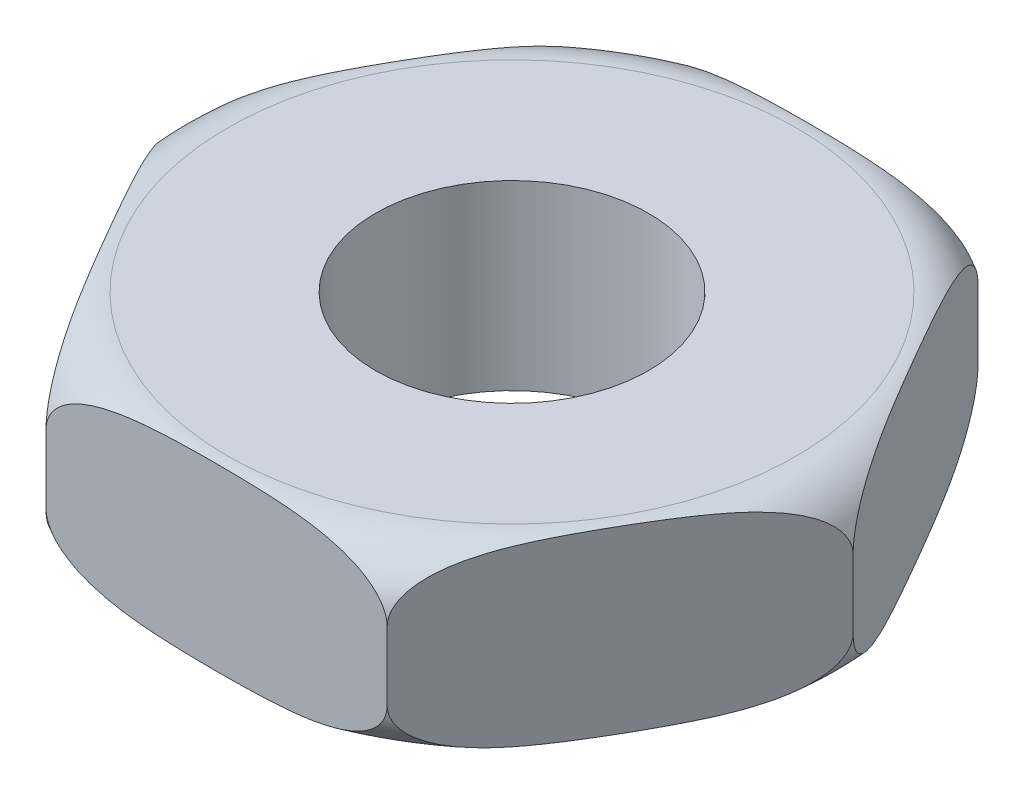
ISO-10303-21;
HEADER;
FILE_DESCRIPTION(('STEP AP214'),'2;1');
FILE_NAME('part.step','',(''),(''),'','','');
FILE_SCHEMA(('AUTOMOTIVE_DESIGN { 1 0 10303 214 1 1 1 1 }'));
ENDSEC;
DATA;
#1=APPLICATION_CONTEXT('core data for automotive mechanical design processes');
#2=APPLICATION_PROTOCOL_DEFINITION('international standard','automotive_design',2000,#1);
#3=PRODUCT_CONTEXT('',#1,'mechanical');
#4=PRODUCT('Part','Part','',(#3));
#5=PRODUCT_RELATED_PRODUCT_CATEGORY('part','',(#4));
#6=PRODUCT_DEFINITION_FORMATION('','',#4);
#7=PRODUCT_DEFINITION_CONTEXT('part definition',#1,'design');
#8=PRODUCT_DEFINITION('design','',#6,#7);
#9=PRODUCT_DEFINITION_SHAPE('','',#8);
#10=(LENGTH_UNIT() NAMED_UNIT(*) SI_UNIT(.MILLI.,.METRE.));
#11=(NAMED_UNIT(*) PLANE_ANGLE_UNIT() SI_UNIT($,.RADIAN.));
#12=(NAMED_UNIT(*) SI_UNIT($,.STERADIAN.) SOLID_ANGLE_UNIT());
#13=UNCERTAINTY_MEASURE_WITH_UNIT(LENGTH_MEASURE(1.E-05),#10,'distance_accuracy_value','');
#14=(GEOMETRIC_REPRESENTATION_CONTEXT(3) GLOBAL_UNCERTAINTY_ASSIGNED_CONTEXT((#13)) GLOBAL_UNIT_ASSIGNED_CONTEXT((#10,
#11,#12)) REPRESENTATION_CONTEXT('',''));
#15=CARTESIAN_POINT('',(0.,0.,0.));
#16=DIRECTION('',(0.,0.,1.));
#17=DIRECTION('',(1.,0.,0.));
#18=AXIS2_PLACEMENT_3D('',#15,#16,#17);
#19=CARTESIAN_POINT('',(7.49999999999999,4.,12.9903810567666));
#20=DIRECTION('',(-0.866025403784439,0.,-0.499999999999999));
#21=DIRECTION('',(-0.499999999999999,0.,0.866025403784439));
#22=AXIS2_PLACEMENT_3D('',#19,#20,#21);
#23=PLANE('',#22);
#24=CARTESIAN_POINT('',(14.999999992,-1.4998,1.38564330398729E-08));
#25=CARTESIAN_POINT('',(15.0000066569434,-1.53711143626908,-1.15301642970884E-05));
#26=CARTESIAN_POINT('',(14.9991699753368,-1.57440262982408,0.00143764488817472));
#27=CARTESIAN_POINT('',(14.9958504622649,-1.64866338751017,0.00718721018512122));
#28=CARTESIAN_POINT('',(14.9933688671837,-1.68563317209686,0.011485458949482));
#29=CARTESIAN_POINT('',(14.9835742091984,-1.79506769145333,0.0284503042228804));
#30=CARTESIAN_POINT('',(14.9739097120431,-1.86673287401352,0.0451897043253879));
#31=CARTESIAN_POINT('',(14.9490718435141,-2.00580636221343,0.0882101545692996));
#32=CARTESIAN_POINT('',(14.9339133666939,-2.07322560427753,0.114465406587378));
#33=CARTESIAN_POINT('',(14.8990027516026,-2.20323534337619,0.174932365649));
#34=CARTESIAN_POINT('',(14.8792406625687,-2.26581498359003,0.209161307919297));
#35=CARTESIAN_POINT('',(14.8223657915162,-2.42365559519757,0.307671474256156));
#36=CARTESIAN_POINT('',(14.7821934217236,-2.51449885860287,0.377252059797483));
#37=CARTESIAN_POINT('',(14.6953021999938,-2.68264982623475,0.527752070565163));
#38=CARTESIAN_POINT('',(14.6485656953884,-2.75991972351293,0.608702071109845));
#39=CARTESIAN_POINT('',(14.5578649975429,-2.89208409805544,0.76580028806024));
#40=CARTESIAN_POINT('',(14.5144793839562,-2.94859841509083,0.840946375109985));
#41=CARTESIAN_POINT('',(14.4254154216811,-3.05395215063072,0.995209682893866));
#42=CARTESIAN_POINT('',(14.379735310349,-3.1027855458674,1.07432995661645));
#43=CARTESIAN_POINT('',(14.2866984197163,-3.19378313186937,1.23547457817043));
#44=CARTESIAN_POINT('',(14.2393398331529,-3.23593984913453,1.31750205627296));
#45=CARTESIAN_POINT('',(14.1434545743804,-3.31438768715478,1.48358019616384));
#46=CARTESIAN_POINT('',(14.0949283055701,-3.35068080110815,1.56763015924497));
#47=CARTESIAN_POINT('',(13.9756992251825,-3.43288083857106,1.77414098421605));
#48=CARTESIAN_POINT('',(13.9045344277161,-3.4760995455,1.89740202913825));
#49=CARTESIAN_POINT('',(13.7610292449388,-3.55397651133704,2.14596029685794));
#50=CARTESIAN_POINT('',(13.6886882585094,-3.58863023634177,2.27125856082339));
#51=CARTESIAN_POINT('',(13.5431250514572,-3.65093148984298,2.52338143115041));
#52=CARTESIAN_POINT('',(13.4699014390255,-3.67856583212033,2.65020844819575));
#53=CARTESIAN_POINT('',(13.3229618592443,-3.72800625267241,2.90471526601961));
#54=CARTESIAN_POINT('',(13.2492458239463,-3.7498115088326,3.03239518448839));
#55=CARTESIAN_POINT('',(13.1009453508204,-3.78878284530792,3.28925913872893));
#56=CARTESIAN_POINT('',(13.0263585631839,-3.80591256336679,3.41844724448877));
#57=CARTESIAN_POINT('',(12.8769850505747,-3.83620985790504,3.67716975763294));
#58=CARTESIAN_POINT('',(12.8021983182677,-3.849377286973,3.80670417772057));
#59=CARTESIAN_POINT('',(12.6525907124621,-3.872487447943,4.06583215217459));
#60=CARTESIAN_POINT('',(12.5777699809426,-3.88243392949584,4.19542546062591));
#61=CARTESIAN_POINT('',(12.4280537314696,-3.89974413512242,4.45474161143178));
#62=CARTESIAN_POINT('',(12.3531582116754,-3.90710779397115,4.58446445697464));
#63=CARTESIAN_POINT('',(12.1575773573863,-3.9236411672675,4.92322043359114));
#64=CARTESIAN_POINT('',(12.0368578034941,-3.93116800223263,5.13231283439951));
#65=CARTESIAN_POINT('',(11.7953736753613,-3.94245892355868,5.55057561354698));
#66=CARTESIAN_POINT('',(11.6746090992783,-3.94622283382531,5.75974599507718));
#67=CARTESIAN_POINT('',(11.432966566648,-3.95087720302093,6.17828313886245));
#68=CARTESIAN_POINT('',(11.3120885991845,-3.95176527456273,6.38764992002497));
#69=CARTESIAN_POINT('',(11.0703393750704,-3.95088883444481,6.80637185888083));
#70=CARTESIAN_POINT('',(10.9494681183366,-3.94912442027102,7.01572701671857));
#71=CARTESIAN_POINT('',(10.7086679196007,-3.9425245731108,7.43280519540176));
#72=CARTESIAN_POINT('',(10.5887388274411,-3.93771268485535,7.64052847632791));
#73=CARTESIAN_POINT('',(10.3489231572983,-3.92395409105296,8.05590140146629));
#74=CARTESIAN_POINT('',(10.2290365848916,-3.91500696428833,8.26355103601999));
#75=CARTESIAN_POINT('',(9.98952999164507,-3.8912416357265,8.67838862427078));
#76=CARTESIAN_POINT('',(9.86990982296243,-3.87642966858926,8.88557683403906));
#77=CARTESIAN_POINT('',(9.6310073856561,-3.83849731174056,9.29936799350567));
#78=CARTESIAN_POINT('',(9.51172503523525,-3.81537914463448,9.50597108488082));
#79=CARTESIAN_POINT('',(9.33719340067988,-3.7729400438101,9.80826874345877));
#80=CARTESIAN_POINT('',(9.28166984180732,-3.75815240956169,9.90443836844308));
#81=CARTESIAN_POINT('',(9.1708375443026,-3.72561186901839,10.0964055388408));
#82=CARTESIAN_POINT('',(9.11552882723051,-3.70785867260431,10.1922030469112));
#83=CARTESIAN_POINT('',(8.94941731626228,-3.64925666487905,10.4799166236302));
#84=CARTESIAN_POINT('',(8.83903920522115,-3.60320341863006,10.6710971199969));
#85=CARTESIAN_POINT('',(8.65407251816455,-3.50948949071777,10.9914688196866));
#86=CARTESIAN_POINT('',(8.5788782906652,-3.46664284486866,11.1217090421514));
#87=CARTESIAN_POINT('',(8.43016851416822,-3.36987315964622,11.3792819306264));
#88=CARTESIAN_POINT('',(8.35665470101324,-3.31593919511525,11.5066115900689));
#89=CARTESIAN_POINT('',(8.21304653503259,-3.19495511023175,11.7553482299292));
#90=CARTESIAN_POINT('',(8.14292888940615,-3.12801741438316,11.8767955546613));
#91=CARTESIAN_POINT('',(8.00731449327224,-2.97772397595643,12.111686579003));
#92=CARTESIAN_POINT('',(7.94180562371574,-2.89441365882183,12.2251512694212));
#93=CARTESIAN_POINT('',(7.8413603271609,-2.74259619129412,12.3991276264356));
#94=CARTESIAN_POINT('',(7.80413879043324,-2.68016927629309,12.4635972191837));
#95=CARTESIAN_POINT('',(7.73374908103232,-2.54646833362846,12.585515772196));
#96=CARTESIAN_POINT('',(7.70058530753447,-2.47518487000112,12.642957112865));
#97=CARTESIAN_POINT('',(7.6395736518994,-2.32240160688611,12.7486324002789));
#98=CARTESIAN_POINT('',(7.61179703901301,-2.24078573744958,12.7967429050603));
#99=CARTESIAN_POINT('',(7.56431516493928,-2.06881540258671,12.8789839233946));
#100=CARTESIAN_POINT('',(7.54457644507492,-1.978499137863,12.913172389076));
#101=CARTESIAN_POINT('',(7.52018334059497,-1.82296529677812,12.9554224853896));
#102=CARTESIAN_POINT('',(7.51268829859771,-1.75952552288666,12.9684042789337));
#103=CARTESIAN_POINT('',(7.50511188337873,-1.66302321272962,12.9815270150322));
#104=CARTESIAN_POINT('',(7.50319724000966,-1.63051325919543,12.9848432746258));
#105=CARTESIAN_POINT('',(7.50063817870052,-1.56527267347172,12.989275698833));
#106=CARTESIAN_POINT('',(7.49999460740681,-1.53254190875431,12.990390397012));
#107=CARTESIAN_POINT('',(7.50000000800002,-1.4998,12.9903810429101));
#108=B_SPLINE_CURVE_WITH_KNOTS('',3,(#24,#25,#26,#27,#28,#29,#30,#31,#32,#33,#34,#35,#36,#37,
#38,#39,#40,#41,#42,#43,#44,#45,#46,#47,#48,#49,#50,#51,#52,#53,#54,#55,#56,#57,#58,#59,#60,#61,
#62,#63,#64,#65,#66,#67,#68,#69,#70,#71,#72,#73,#74,#75,#76,#77,#78,#79,#80,#81,#82,#83,#84,#85,
#86,#87,#88,#89,#90,#91,#92,#93,#94,#95,#96,#97,#98,#99,#100,#101,#102,#103,#104,#105,#106,
#107),.UNSPECIFIED.,.F.,.F.,(4,2,2,2,2,2,2,2,2,2,2,2,2,2,2,2,2,2,2,2,2,2,2,2,2,2,2,2,2,2,2,2,2,
2,2,2,2,2,2,2,2,4),(0.,0.111857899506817,0.223631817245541,0.445182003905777,0.666135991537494,
0.887572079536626,1.24931989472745,1.61205986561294,1.92227225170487,2.23272670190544,
2.54352623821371,2.85421990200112,3.30010292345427,3.74622147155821,4.19317197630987,
4.64018548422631,5.09058235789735,5.54099598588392,5.99088336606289,6.44078210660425,
7.16540446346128,7.89006072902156,8.61531841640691,9.3405494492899,10.0602445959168,
10.7800130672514,11.4990184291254,12.2178315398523,12.5538757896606,12.8899529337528,
13.5657861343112,14.034589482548,14.5038570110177,14.9692348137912,15.4333392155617,
15.7242255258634,16.0154244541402,16.3102462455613,16.603827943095,16.7986457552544,
16.8967592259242,16.9949380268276),.UNSPECIFIED.);
#109=CARTESIAN_POINT('',(15.,-1.5,0.));
#110=VERTEX_POINT('',#109);
#111=CARTESIAN_POINT('',(7.49999999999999,-1.49999999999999,12.9903810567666));
#112=VERTEX_POINT('',#111);
#113=EDGE_CURVE('E45',#110,#112,#108,.T.);
#114=ORIENTED_EDGE('',*,*,#113,.F.);
#115=DIRECTION('',(0.,-1.,0.));
#116=VECTOR('',#115,1.);
#117=CARTESIAN_POINT('',(15.,4.,0.));
#118=LINE('',#117,#116);
#119=CARTESIAN_POINT('',(15.,1.5,0.));
#120=VERTEX_POINT('',#119);
#121=EDGE_CURVE('E38',#120,#110,#118,.T.);
#122=ORIENTED_EDGE('',*,*,#121,.F.);
#123=CARTESIAN_POINT('',(7.500000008,1.4998,12.9903810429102));
#124=CARTESIAN_POINT('',(7.49999334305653,1.53711143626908,12.9903925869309));
#125=CARTESIAN_POINT('',(7.50083002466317,1.57440262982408,12.9889434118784));
#126=CARTESIAN_POINT('',(7.50414953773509,1.64866338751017,12.9831938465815));
#127=CARTESIAN_POINT('',(7.50663113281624,1.68563317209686,12.9788955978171));
#128=CARTESIAN_POINT('',(7.51642579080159,1.79506769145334,12.9619307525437));
#129=CARTESIAN_POINT('',(7.52609028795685,1.86673287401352,12.9451913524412));
#130=CARTESIAN_POINT('',(7.55092815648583,2.00580636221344,12.9021709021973));
#131=CARTESIAN_POINT('',(7.56608663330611,2.07322560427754,12.8759156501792));
#132=CARTESIAN_POINT('',(7.60099724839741,2.20323534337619,12.8154486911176));
#133=CARTESIAN_POINT('',(7.62075933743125,2.26581498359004,12.7812197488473));
#134=CARTESIAN_POINT('',(7.67763420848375,2.42365559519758,12.6827095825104));
#135=CARTESIAN_POINT('',(7.71780657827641,2.51449885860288,12.6131289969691));
#136=CARTESIAN_POINT('',(7.80469780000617,2.68264982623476,12.4626289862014));
#137=CARTESIAN_POINT('',(7.85143430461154,2.75991972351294,12.3816789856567));
#138=CARTESIAN_POINT('',(7.94213500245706,2.89208409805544,12.2245807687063));
#139=CARTESIAN_POINT('',(7.98552061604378,2.94859841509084,12.1494346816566));
#140=CARTESIAN_POINT('',(8.07458457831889,3.05395215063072,11.9951713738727));
#141=CARTESIAN_POINT('',(8.12026468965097,3.1027855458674,11.9160511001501));
#142=CARTESIAN_POINT('',(8.21330158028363,3.19378313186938,11.7549064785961));
#143=CARTESIAN_POINT('',(8.26066016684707,3.23593984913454,11.6728790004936));
#144=CARTESIAN_POINT('',(8.35654542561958,3.31438768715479,11.5068008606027));
#145=CARTESIAN_POINT('',(8.40507169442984,3.35068080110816,11.4227508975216));
#146=CARTESIAN_POINT('',(8.52430077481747,3.43288083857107,11.2162400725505));
#147=CARTESIAN_POINT('',(8.5954655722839,3.47609954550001,11.0929790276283));
#148=CARTESIAN_POINT('',(8.73897075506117,3.55397651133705,10.8444207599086));
#149=CARTESIAN_POINT('',(8.81131174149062,3.58863023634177,10.7191224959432));
#150=CARTESIAN_POINT('',(8.95687494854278,3.65093148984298,10.4669996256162));
#151=CARTESIAN_POINT('',(9.03009856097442,3.67856583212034,10.3401726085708));
#152=CARTESIAN_POINT('',(9.17703814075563,3.72800625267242,10.085665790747));
#153=CARTESIAN_POINT('',(9.25075417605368,3.74981150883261,9.95798587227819));
#154=CARTESIAN_POINT('',(9.39905464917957,3.78878284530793,9.70112191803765));
#155=CARTESIAN_POINT('',(9.47364143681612,3.8059125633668,9.57193381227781));
#156=CARTESIAN_POINT('',(9.62301494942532,3.83620985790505,9.31321129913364));
#157=CARTESIAN_POINT('',(9.69780168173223,3.84937728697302,9.18367687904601));
#158=CARTESIAN_POINT('',(9.84740928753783,3.87248744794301,8.92454890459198));
#159=CARTESIAN_POINT('',(9.92223001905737,3.88243392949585,8.79495559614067));
#160=CARTESIAN_POINT('',(10.0719462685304,3.89974413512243,8.53563944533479));
#161=CARTESIAN_POINT('',(10.1468417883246,3.90710779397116,8.40591659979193));
#162=CARTESIAN_POINT('',(10.3424226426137,3.92364116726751,8.06716062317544));
#163=CARTESIAN_POINT('',(10.4631421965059,3.93116800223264,7.85806822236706));
#164=CARTESIAN_POINT('',(10.7046263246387,3.94245892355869,7.43980544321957));
#165=CARTESIAN_POINT('',(10.8253909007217,3.94622283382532,7.23063506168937));
#166=CARTESIAN_POINT('',(11.067033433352,3.95087720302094,6.81209791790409));
#167=CARTESIAN_POINT('',(11.1879114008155,3.95176527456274,6.60273113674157));
#168=CARTESIAN_POINT('',(11.4296606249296,3.95088883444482,6.18400919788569));
#169=CARTESIAN_POINT('',(11.5505318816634,3.94912442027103,5.97465404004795));
#170=CARTESIAN_POINT('',(11.7913320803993,3.94252457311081,5.55757586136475));
#171=CARTESIAN_POINT('',(11.9112611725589,3.93771268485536,5.34985258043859));
#172=CARTESIAN_POINT('',(12.1510768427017,3.92395409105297,4.9344796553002));
#173=CARTESIAN_POINT('',(12.2709634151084,3.91500696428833,4.7268300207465));
#174=CARTESIAN_POINT('',(12.510470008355,3.89124163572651,4.3119924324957));
#175=CARTESIAN_POINT('',(12.6300901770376,3.87642966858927,4.10480422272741));
#176=CARTESIAN_POINT('',(12.8689926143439,3.83849731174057,3.69101306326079));
#177=CARTESIAN_POINT('',(12.9882749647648,3.81537914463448,3.48440997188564));
#178=CARTESIAN_POINT('',(13.1628065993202,3.7729400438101,3.18211231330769));
#179=CARTESIAN_POINT('',(13.2183301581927,3.75815240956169,3.08594268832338));
#180=CARTESIAN_POINT('',(13.3291624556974,3.72561186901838,2.89397551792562));
#181=CARTESIAN_POINT('',(13.3844711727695,3.70785867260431,2.79817800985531));
#182=CARTESIAN_POINT('',(13.5505826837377,3.64925666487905,2.51046443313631));
#183=CARTESIAN_POINT('',(13.6609607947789,3.60320341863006,2.31928393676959));
#184=CARTESIAN_POINT('',(13.8459274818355,3.50948949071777,1.99891223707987));
#185=CARTESIAN_POINT('',(13.9211217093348,3.46664284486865,1.86867201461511));
#186=CARTESIAN_POINT('',(14.0698314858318,3.36987315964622,1.61109912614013));
#187=CARTESIAN_POINT('',(14.1433452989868,3.31593919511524,1.48376946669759));
#188=CARTESIAN_POINT('',(14.2869534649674,3.19495511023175,1.23503282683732));
#189=CARTESIAN_POINT('',(14.3570711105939,3.12801741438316,1.11358550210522));
#190=CARTESIAN_POINT('',(14.4926855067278,2.97772397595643,0.878694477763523));
#191=CARTESIAN_POINT('',(14.5581943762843,2.89441365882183,0.76522978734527));
#192=CARTESIAN_POINT('',(14.6586396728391,2.74259619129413,0.591253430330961));
#193=CARTESIAN_POINT('',(14.6958612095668,2.6801692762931,0.526783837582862));
#194=CARTESIAN_POINT('',(14.7662509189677,2.54646833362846,0.40486528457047));
#195=CARTESIAN_POINT('',(14.7994146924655,2.47518487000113,0.34742394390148));
#196=CARTESIAN_POINT('',(14.8604263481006,2.32240160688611,0.241748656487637));
#197=CARTESIAN_POINT('',(14.888202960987,2.24078573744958,0.193638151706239));
#198=CARTESIAN_POINT('',(14.9356848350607,2.06881540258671,0.111397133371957));
#199=CARTESIAN_POINT('',(14.9554235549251,1.978499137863,0.0772086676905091));
#200=CARTESIAN_POINT('',(14.979816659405,1.82296529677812,0.0349585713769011));
#201=CARTESIAN_POINT('',(14.9873117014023,1.75952552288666,0.0219767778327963));
#202=CARTESIAN_POINT('',(14.9948881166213,1.66302321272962,0.00885404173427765));
#203=CARTESIAN_POINT('',(14.9968027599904,1.63051325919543,0.00553778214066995));
#204=CARTESIAN_POINT('',(14.9993618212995,1.56527267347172,0.00110535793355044));
#205=CARTESIAN_POINT('',(15.0000053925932,1.53254190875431,-9.34024544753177E-06));
#206=CARTESIAN_POINT('',(14.999999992,1.4998,1.38563962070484E-08));
#207=B_SPLINE_CURVE_WITH_KNOTS('',3,(#123,#124,#125,#126,#127,#128,#129,#130,#131,#132,#133,
#134,#135,#136,#137,#138,#139,#140,#141,#142,#143,#144,#145,#146,#147,#148,#149,#150,#151,#152,
#153,#154,#155,#156,#157,#158,#159,#160,#161,#162,#163,#164,#165,#166,#167,#168,#169,#170,#171,
#172,#173,#174,#175,#176,#177,#178,#179,#180,#181,#182,#183,#184,#185,#186,#187,#188,#189,#190,
#191,#192,#193,#194,#195,#196,#197,#198,#199,#200,#201,#202,#203,#204,#205,#206),.UNSPECIFIED.,
.F.,.F.,(4,2,2,2,2,2,2,2,2,2,2,2,2,2,2,2,2,2,2,2,2,2,2,2,2,2,2,2,2,2,2,2,2,2,2,2,2,2,2,2,2,4),
(0.,0.111857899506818,0.223631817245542,0.44518200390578,0.666135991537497,0.887572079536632,
1.24931989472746,1.61205986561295,1.92227225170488,2.23272670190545,2.54352623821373,
2.85421990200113,3.30010292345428,3.74622147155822,4.19317197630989,4.64018548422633,
5.09058235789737,5.54099598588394,5.99088336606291,6.44078210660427,7.16540446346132,
7.89006072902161,8.61531841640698,9.34054944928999,10.0602445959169,10.7800130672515,
11.4990184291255,12.2178315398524,12.5538757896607,12.889952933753,13.5657861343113,
14.0345894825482,14.5038570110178,14.9692348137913,15.4333392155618,15.7242255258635,
16.0154244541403,16.3102462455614,16.6038279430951,16.7986457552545,16.8967592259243,
16.9949380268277),.UNSPECIFIED.);
#208=CARTESIAN_POINT('',(7.49999999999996,1.5,12.9903810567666));
#209=VERTEX_POINT('',#208);
#210=EDGE_CURVE('E119',#209,#120,#207,.T.);
#211=ORIENTED_EDGE('',*,*,#210,.F.);
#212=DIRECTION('',(0.,-1.,0.));
#213=VECTOR('',#212,1.);
#214=CARTESIAN_POINT('',(7.49999999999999,4.,12.9903810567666));
#215=LINE('',#214,#213);
#216=EDGE_CURVE('E94',#209,#112,#215,.T.);
#217=ORIENTED_EDGE('',*,*,#216,.T.);
#218=EDGE_LOOP('',(#114,#122,#211,#217));
#219=FACE_BOUND('',#218,.T.);
#220=ADVANCED_FACE('F26',(#219),#23,.F.);
#221=CARTESIAN_POINT('',(15.,4.,0.));
#222=DIRECTION('',(-0.866025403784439,0.,0.5));
#223=DIRECTION('',(0.5,0.,0.866025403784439));
#224=AXIS2_PLACEMENT_3D('',#221,#222,#223);
#225=PLANE('',#224);
#226=CARTESIAN_POINT('',(7.50000000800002,-1.4998,-12.9903810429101));
#227=CARTESIAN_POINT('',(7.49999334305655,-1.53711143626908,-12.9903925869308));
#228=CARTESIAN_POINT('',(7.50083002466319,-1.57440262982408,-12.9889434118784));
#229=CARTESIAN_POINT('',(7.50414953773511,-1.64866338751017,-12.9831938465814));
#230=CARTESIAN_POINT('',(7.50663113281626,-1.68563317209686,-12.9788955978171));
#231=CARTESIAN_POINT('',(7.51642579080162,-1.79506769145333,-12.9619307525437));
#232=CARTESIAN_POINT('',(7.52609028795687,-1.86673287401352,-12.9451913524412));
#233=CARTESIAN_POINT('',(7.55092815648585,-2.00580636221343,-12.9021709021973));
#234=CARTESIAN_POINT('',(7.56608663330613,-2.07322560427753,-12.8759156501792));
#235=CARTESIAN_POINT('',(7.60099724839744,-2.20323534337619,-12.8154486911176));
#236=CARTESIAN_POINT('',(7.62075933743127,-2.26581498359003,-12.7812197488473));
#237=CARTESIAN_POINT('',(7.67763420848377,-2.42365559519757,-12.6827095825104));
#238=CARTESIAN_POINT('',(7.71780657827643,-2.51449885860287,-12.6131289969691));
#239=CARTESIAN_POINT('',(7.80469780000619,-2.68264982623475,-12.4626289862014));
#240=CARTESIAN_POINT('',(7.85143430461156,-2.75991972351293,-12.3816789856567));
#241=CARTESIAN_POINT('',(7.94213500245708,-2.89208409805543,-12.2245807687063));
#242=CARTESIAN_POINT('',(7.9855206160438,-2.94859841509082,-12.1494346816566));
#243=CARTESIAN_POINT('',(8.0745845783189,-3.05395215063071,-11.9951713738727));
#244=CARTESIAN_POINT('',(8.12026468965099,-3.10278554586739,-11.9160511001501));
#245=CARTESIAN_POINT('',(8.21330158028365,-3.19378313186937,-11.7549064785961));
#246=CARTESIAN_POINT('',(8.26066016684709,-3.23593984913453,-11.6728790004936));
#247=CARTESIAN_POINT('',(8.3565454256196,-3.31438768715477,-11.5068008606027));
#248=CARTESIAN_POINT('',(8.40507169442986,-3.35068080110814,-11.4227508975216));
#249=CARTESIAN_POINT('',(8.5243007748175,-3.43288083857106,-11.2162400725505));
#250=CARTESIAN_POINT('',(8.59546557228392,-3.4760995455,-11.0929790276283));
#251=CARTESIAN_POINT('',(8.73897075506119,-3.55397651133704,-10.8444207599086));
#252=CARTESIAN_POINT('',(8.81131174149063,-3.58863023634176,-10.7191224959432));
#253=CARTESIAN_POINT('',(8.9568749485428,-3.65093148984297,-10.4669996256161));
#254=CARTESIAN_POINT('',(9.03009856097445,-3.67856583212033,-10.3401726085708));
#255=CARTESIAN_POINT('',(9.17703814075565,-3.72800625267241,-10.0856657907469));
#256=CARTESIAN_POINT('',(9.25075417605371,-3.7498115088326,-9.95798587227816));
#257=CARTESIAN_POINT('',(9.39905464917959,-3.78878284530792,-9.70112191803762));
#258=CARTESIAN_POINT('',(9.47364143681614,-3.80591256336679,-9.57193381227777));
#259=CARTESIAN_POINT('',(9.62301494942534,-3.83620985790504,-9.31321129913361));
#260=CARTESIAN_POINT('',(9.69780168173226,-3.849377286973,-9.18367687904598));
#261=CARTESIAN_POINT('',(9.84740928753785,-3.872487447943,-8.92454890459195));
#262=CARTESIAN_POINT('',(9.92223001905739,-3.88243392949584,-8.79495559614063));
#263=CARTESIAN_POINT('',(10.0719462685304,-3.89974413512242,-8.53563944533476));
#264=CARTESIAN_POINT('',(10.1468417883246,-3.90710779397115,-8.4059165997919));
#265=CARTESIAN_POINT('',(10.3424226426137,-3.9236411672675,-8.06716062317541));
#266=CARTESIAN_POINT('',(10.4631421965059,-3.93116800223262,-7.85806822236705));
#267=CARTESIAN_POINT('',(10.7046263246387,-3.94245892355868,-7.43980544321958));
#268=CARTESIAN_POINT('',(10.8253909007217,-3.94622283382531,-7.23063506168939));
#269=CARTESIAN_POINT('',(11.0670334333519,-3.95087720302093,-6.81209791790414));
#270=CARTESIAN_POINT('',(11.1879114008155,-3.95176527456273,-6.60273113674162));
#271=CARTESIAN_POINT('',(11.4296606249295,-3.95088883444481,-6.18400919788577));
#272=CARTESIAN_POINT('',(11.5505318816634,-3.94912442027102,-5.97465404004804));
#273=CARTESIAN_POINT('',(11.7913320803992,-3.9425245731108,-5.55757586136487));
#274=CARTESIAN_POINT('',(11.9112611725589,-3.93771268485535,-5.34985258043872));
#275=CARTESIAN_POINT('',(12.1510768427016,-3.92395409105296,-4.93447965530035));
#276=CARTESIAN_POINT('',(12.2709634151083,-3.91500696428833,-4.72683002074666));
#277=CARTESIAN_POINT('',(12.5104700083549,-3.89124163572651,-4.31199243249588));
#278=CARTESIAN_POINT('',(12.6300901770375,-3.87642966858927,-4.1048042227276));
#279=CARTESIAN_POINT('',(12.8689926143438,-3.83849731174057,-3.69101306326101));
#280=CARTESIAN_POINT('',(12.9882749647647,-3.81537914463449,-3.48440997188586));
#281=CARTESIAN_POINT('',(13.16280659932,-3.77294004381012,-3.18211231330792));
#282=CARTESIAN_POINT('',(13.2183301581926,-3.7581524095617,-3.0859426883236));
#283=CARTESIAN_POINT('',(13.3291624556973,-3.7256118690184,-2.89397551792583));
#284=CARTESIAN_POINT('',(13.3844711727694,-3.70785867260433,-2.79817800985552));
#285=CARTESIAN_POINT('',(13.5505826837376,-3.64925666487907,-2.51046443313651));
#286=CARTESIAN_POINT('',(13.6609607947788,-3.60320341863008,-2.31928393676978));
#287=CARTESIAN_POINT('',(13.8459274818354,-3.5094894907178,-1.99891223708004));
#288=CARTESIAN_POINT('',(13.9211217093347,-3.46664284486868,-1.86867201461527));
#289=CARTESIAN_POINT('',(14.0698314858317,-3.36987315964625,-1.61109912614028));
#290=CARTESIAN_POINT('',(14.1433452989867,-3.31593919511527,-1.48376946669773));
#291=CARTESIAN_POINT('',(14.2869534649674,-3.19495511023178,-1.23503282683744));
#292=CARTESIAN_POINT('',(14.3570711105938,-3.12801741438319,-1.11358550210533));
#293=CARTESIAN_POINT('',(14.4926855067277,-2.97772397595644,-0.878694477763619));
#294=CARTESIAN_POINT('',(14.5581943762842,-2.89441365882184,-0.765229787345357));
#295=CARTESIAN_POINT('',(14.6586396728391,-2.74259619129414,-0.591253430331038));
#296=CARTESIAN_POINT('',(14.6958612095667,-2.68016927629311,-0.526783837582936));
#297=CARTESIAN_POINT('',(14.7662509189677,-2.54646833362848,-0.404865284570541));
#298=CARTESIAN_POINT('',(14.7994146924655,-2.47518487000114,-0.34742394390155));
#299=CARTESIAN_POINT('',(14.8604263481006,-2.32240160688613,-0.241748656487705));
#300=CARTESIAN_POINT('',(14.888202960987,-2.2407857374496,-0.193638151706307));
#301=CARTESIAN_POINT('',(14.9356848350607,-2.06881540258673,-0.111397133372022));
#302=CARTESIAN_POINT('',(14.9554235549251,-1.97849913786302,-0.0772086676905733));
#303=CARTESIAN_POINT('',(14.979816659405,-1.82296529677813,-0.0349585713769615));
#304=CARTESIAN_POINT('',(14.9873117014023,-1.75952552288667,-0.0219767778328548));
#305=CARTESIAN_POINT('',(14.9948881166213,-1.66302321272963,-0.00885404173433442));
#306=CARTESIAN_POINT('',(14.9968027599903,-1.63051325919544,-0.00553778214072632));
#307=CARTESIAN_POINT('',(14.9993618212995,-1.56527267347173,-0.00110535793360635));
#308=CARTESIAN_POINT('',(15.0000053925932,-1.53254190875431,9.34024539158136E-06));
#309=CARTESIAN_POINT('',(14.999999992,-1.4998,-1.38564526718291E-08));
#310=B_SPLINE_CURVE_WITH_KNOTS('',3,(#226,#227,#228,#229,#230,#231,#232,#233,#234,#235,#236,
#237,#238,#239,#240,#241,#242,#243,#244,#245,#246,#247,#248,#249,#250,#251,#252,#253,#254,#255,
#256,#257,#258,#259,#260,#261,#262,#263,#264,#265,#266,#267,#268,#269,#270,#271,#272,#273,#274,
#275,#276,#277,#278,#279,#280,#281,#282,#283,#284,#285,#286,#287,#288,#289,#290,#291,#292,#293,
#294,#295,#296,#297,#298,#299,#300,#301,#302,#303,#304,#305,#306,#307,#308,#309),.UNSPECIFIED.,
.F.,.F.,(4,2,2,2,2,2,2,2,2,2,2,2,2,2,2,2,2,2,2,2,2,2,2,2,2,2,2,2,2,2,2,2,2,2,2,2,2,2,2,2,2,4),
(0.,0.111857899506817,0.22363181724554,0.445182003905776,0.666135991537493,0.887572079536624,
1.24931989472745,1.61205986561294,1.92227225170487,2.23272670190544,2.54352623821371,
2.85421990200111,3.30010292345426,3.74622147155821,4.19317197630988,4.64018548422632,
5.09058235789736,5.54099598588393,5.9908833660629,6.44078210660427,7.16540446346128,
7.89006072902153,8.61531841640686,9.34054944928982,10.0602445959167,10.7800130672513,
11.4990184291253,12.2178315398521,12.5538757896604,12.8899529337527,13.5657861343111,
14.0345894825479,14.5038570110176,14.9692348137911,15.4333392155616,15.7242255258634,
16.0154244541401,16.3102462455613,16.6038279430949,16.7986457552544,16.8967592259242,
16.9949380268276),.UNSPECIFIED.);
#311=CARTESIAN_POINT('',(7.49999999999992,-1.5,-12.9903810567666));
#312=VERTEX_POINT('',#311);
#313=EDGE_CURVE('E80',#312,#110,#310,.T.);
#314=ORIENTED_EDGE('',*,*,#313,.F.);
#315=DIRECTION('',(0.,-1.,0.));
#316=VECTOR('',#315,1.);
#317=CARTESIAN_POINT('',(7.49999999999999,4.,-12.9903810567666));
#318=LINE('',#317,#316);
#319=CARTESIAN_POINT('',(7.49999999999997,1.5,-12.9903810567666));
#320=VERTEX_POINT('',#319);
#321=EDGE_CURVE('E100',#320,#312,#318,.T.);
#322=ORIENTED_EDGE('',*,*,#321,.F.);
#323=CARTESIAN_POINT('',(14.999999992,1.4998,-1.38564162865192E-08));
#324=CARTESIAN_POINT('',(15.0000066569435,1.53711143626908,1.15301643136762E-05));
#325=CARTESIAN_POINT('',(14.9991699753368,1.57440262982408,-0.00143764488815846));
#326=CARTESIAN_POINT('',(14.9958504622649,1.64866338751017,-0.00718721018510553));
#327=CARTESIAN_POINT('',(14.9933688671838,1.68563317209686,-0.0114854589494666));
#328=CARTESIAN_POINT('',(14.9835742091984,1.79506769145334,-0.0284503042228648));
#329=CARTESIAN_POINT('',(14.9739097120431,1.86673287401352,-0.045189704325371));
#330=CARTESIAN_POINT('',(14.9490718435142,2.00580636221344,-0.0882101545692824));
#331=CARTESIAN_POINT('',(14.9339133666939,2.07322560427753,-0.114465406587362));
#332=CARTESIAN_POINT('',(14.8990027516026,2.20323534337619,-0.174932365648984));
#333=CARTESIAN_POINT('',(14.8792406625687,2.26581498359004,-0.20916130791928));
#334=CARTESIAN_POINT('',(14.8223657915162,2.42365559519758,-0.307671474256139));
#335=CARTESIAN_POINT('',(14.7821934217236,2.51449885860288,-0.377252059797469));
#336=CARTESIAN_POINT('',(14.6953021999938,2.68264982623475,-0.52775207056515));
#337=CARTESIAN_POINT('',(14.6485656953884,2.75991972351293,-0.608702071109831));
#338=CARTESIAN_POINT('',(14.5578649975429,2.89208409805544,-0.765800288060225));
#339=CARTESIAN_POINT('',(14.5144793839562,2.94859841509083,-0.840946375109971));
#340=CARTESIAN_POINT('',(14.4254154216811,3.05395215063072,-0.995209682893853));
#341=CARTESIAN_POINT('',(14.379735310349,3.1027855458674,-1.07432995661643));
#342=CARTESIAN_POINT('',(14.2866984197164,3.19378313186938,-1.23547457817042));
#343=CARTESIAN_POINT('',(14.2393398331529,3.23593984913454,-1.31750205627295));
#344=CARTESIAN_POINT('',(14.1434545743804,3.31438768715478,-1.48358019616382));
#345=CARTESIAN_POINT('',(14.0949283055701,3.35068080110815,-1.56763015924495));
#346=CARTESIAN_POINT('',(13.9756992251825,3.43288083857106,-1.77414098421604));
#347=CARTESIAN_POINT('',(13.9045344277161,3.47609954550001,-1.89740202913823));
#348=CARTESIAN_POINT('',(13.7610292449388,3.55397651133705,-2.14596029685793));
#349=CARTESIAN_POINT('',(13.6886882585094,3.58863023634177,-2.27125856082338));
#350=CARTESIAN_POINT('',(13.5431250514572,3.65093148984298,-2.52338143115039));
#351=CARTESIAN_POINT('',(13.4699014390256,3.67856583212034,-2.65020844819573));
#352=CARTESIAN_POINT('',(13.3229618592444,3.72800625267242,-2.9047152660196));
#353=CARTESIAN_POINT('',(13.2492458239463,3.74981150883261,-3.03239518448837));
#354=CARTESIAN_POINT('',(13.1009453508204,3.78878284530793,-3.28925913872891));
#355=CARTESIAN_POINT('',(13.0263585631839,3.8059125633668,-3.41844724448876));
#356=CARTESIAN_POINT('',(12.8769850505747,3.83620985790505,-3.67716975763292));
#357=CARTESIAN_POINT('',(12.8021983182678,3.84937728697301,-3.80670417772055));
#358=CARTESIAN_POINT('',(12.6525907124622,3.87248744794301,-4.06583215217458));
#359=CARTESIAN_POINT('',(12.5777699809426,3.88243392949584,-4.19542546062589));
#360=CARTESIAN_POINT('',(12.4280537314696,3.89974413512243,-4.45474161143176));
#361=CARTESIAN_POINT('',(12.3531582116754,3.90710779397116,-4.58446445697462));
#362=CARTESIAN_POINT('',(12.1575773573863,3.92364116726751,-4.92322043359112));
#363=CARTESIAN_POINT('',(12.0368578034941,3.93116800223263,-5.1323128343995));
#364=CARTESIAN_POINT('',(11.7953736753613,3.94245892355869,-5.55057561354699));
#365=CARTESIAN_POINT('',(11.6746090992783,3.94622283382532,-5.75974599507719));
#366=CARTESIAN_POINT('',(11.432966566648,3.95087720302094,-6.17828313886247));
#367=CARTESIAN_POINT('',(11.3120885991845,3.95176527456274,-6.387649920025));
#368=CARTESIAN_POINT('',(11.0703393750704,3.95088883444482,-6.80637185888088));
#369=CARTESIAN_POINT('',(10.9494681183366,3.94912442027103,-7.01572701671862));
#370=CARTESIAN_POINT('',(10.7086679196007,3.94252457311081,-7.43280519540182));
#371=CARTESIAN_POINT('',(10.588738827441,3.93771268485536,-7.64052847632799));
#372=CARTESIAN_POINT('',(10.3489231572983,3.92395409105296,-8.05590140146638));
#373=CARTESIAN_POINT('',(10.2290365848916,3.91500696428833,-8.26355103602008));
#374=CARTESIAN_POINT('',(9.98952999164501,3.89124163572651,-8.67838862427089));
#375=CARTESIAN_POINT('',(9.86990982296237,3.87642966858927,-8.88557683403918));
#376=CARTESIAN_POINT('',(9.63100738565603,3.83849731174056,-9.2993679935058));
#377=CARTESIAN_POINT('',(9.51172503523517,3.81537914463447,-9.50597108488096));
#378=CARTESIAN_POINT('',(9.3371934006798,3.7729400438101,-9.80826874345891));
#379=CARTESIAN_POINT('',(9.28166984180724,3.75815240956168,-9.90443836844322));
#380=CARTESIAN_POINT('',(9.17083754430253,3.72561186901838,-10.096405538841));
#381=CARTESIAN_POINT('',(9.11552882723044,3.7078586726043,-10.1922030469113));
#382=CARTESIAN_POINT('',(8.94941731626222,3.64925666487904,-10.4799166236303));
#383=CARTESIAN_POINT('',(8.83903920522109,3.60320341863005,-10.671097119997));
#384=CARTESIAN_POINT('',(8.65407251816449,3.50948949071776,-10.9914688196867));
#385=CARTESIAN_POINT('',(8.57887829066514,3.46664284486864,-11.1217090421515));
#386=CARTESIAN_POINT('',(8.43016851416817,3.36987315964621,-11.3792819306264));
#387=CARTESIAN_POINT('',(8.3566547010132,3.31593919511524,-11.506611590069));
#388=CARTESIAN_POINT('',(8.21304653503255,3.19495511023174,-11.7553482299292));
#389=CARTESIAN_POINT('',(8.14292888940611,3.12801741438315,-11.8767955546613));
#390=CARTESIAN_POINT('',(8.00731449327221,2.97772397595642,-12.111686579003));
#391=CARTESIAN_POINT('',(7.94180562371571,2.89441365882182,-12.2251512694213));
#392=CARTESIAN_POINT('',(7.84136032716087,2.74259619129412,-12.3991276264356));
#393=CARTESIAN_POINT('',(7.80413879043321,2.68016927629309,-12.4635972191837));
#394=CARTESIAN_POINT('',(7.7337490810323,2.54646833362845,-12.5855157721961));
#395=CARTESIAN_POINT('',(7.70058530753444,2.47518487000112,-12.6429571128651));
#396=CARTESIAN_POINT('',(7.63957365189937,2.32240160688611,-12.7486324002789));
#397=CARTESIAN_POINT('',(7.61179703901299,2.24078573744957,-12.7967429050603));
#398=CARTESIAN_POINT('',(7.56431516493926,2.0688154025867,-12.8789839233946));
#399=CARTESIAN_POINT('',(7.5445764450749,1.97849913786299,-12.913172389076));
#400=CARTESIAN_POINT('',(7.52018334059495,1.82296529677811,-12.9554224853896));
#401=CARTESIAN_POINT('',(7.51268829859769,1.75952552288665,-12.9684042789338));
#402=CARTESIAN_POINT('',(7.50511188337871,1.66302321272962,-12.9815270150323));
#403=CARTESIAN_POINT('',(7.50319724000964,1.63051325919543,-12.9848432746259));
#404=CARTESIAN_POINT('',(7.50063817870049,1.56527267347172,-12.989275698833));
#405=CARTESIAN_POINT('',(7.49999460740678,1.53254190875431,-12.990390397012));
#406=CARTESIAN_POINT('',(7.500000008,1.4998,-12.9903810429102));
#407=B_SPLINE_CURVE_WITH_KNOTS('',3,(#323,#324,#325,#326,#327,#328,#329,#330,#331,#332,#333,
#334,#335,#336,#337,#338,#339,#340,#341,#342,#343,#344,#345,#346,#347,#348,#349,#350,#351,#352,
#353,#354,#355,#356,#357,#358,#359,#360,#361,#362,#363,#364,#365,#366,#367,#368,#369,#370,#371,
#372,#373,#374,#375,#376,#377,#378,#379,#380,#381,#382,#383,#384,#385,#386,#387,#388,#389,#390,
#391,#392,#393,#394,#395,#396,#397,#398,#399,#400,#401,#402,#403,#404,#405,#406),.UNSPECIFIED.,
.F.,.F.,(4,2,2,2,2,2,2,2,2,2,2,2,2,2,2,2,2,2,2,2,2,2,2,2,2,2,2,2,2,2,2,2,2,2,2,2,2,2,2,2,2,4),
(0.,0.111857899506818,0.223631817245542,0.445182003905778,0.666135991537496,0.887572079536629,
1.24931989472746,1.61205986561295,1.92227225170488,2.23272670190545,2.54352623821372,
2.85421990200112,3.30010292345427,3.74622147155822,4.19317197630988,4.64018548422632,
5.09058235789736,5.54099598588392,5.99088336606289,6.44078210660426,7.16540446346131,
7.8900607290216,8.61531841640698,9.34054944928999,10.0602445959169,10.7800130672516,
11.4990184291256,12.2178315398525,12.5538757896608,12.889952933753,13.5657861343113,
14.0345894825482,14.5038570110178,14.9692348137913,15.4333392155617,15.7242255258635,
16.0154244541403,16.3102462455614,16.603827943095,16.7986457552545,16.8967592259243,
16.9949380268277),.UNSPECIFIED.);
#408=EDGE_CURVE('E99',#120,#320,#407,.T.);
#409=ORIENTED_EDGE('',*,*,#408,.F.);
#410=ORIENTED_EDGE('',*,*,#121,.T.);
#411=EDGE_LOOP('',(#314,#322,#409,#410));
#412=FACE_BOUND('',#411,.T.);
#413=ADVANCED_FACE('F98',(#412),#225,.F.);
#414=CARTESIAN_POINT('',(7.49999999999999,4.,-12.9903810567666));
#415=DIRECTION('',(0.,0.,1.));
#416=DIRECTION('',(1.,0.,0.));
#417=AXIS2_PLACEMENT_3D('',#414,#415,#416);
#418=PLANE('',#417);
#419=CARTESIAN_POINT('',(0.,-3.95143354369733,-12.9903810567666));
#420=CARTESIAN_POINT('',(0.209925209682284,-3.95143076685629,-12.9903810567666));
#421=CARTESIAN_POINT('',(0.419850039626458,-3.95043073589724,-12.9903810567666));
#422=CARTESIAN_POINT('',(0.839677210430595,-3.94623380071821,-12.9903810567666));
#423=CARTESIAN_POINT('',(1.04957955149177,-3.94303691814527,-12.9903810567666));
#424=CARTESIAN_POINT('',(1.46958832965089,-3.93387326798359,-12.9903810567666));
#425=CARTESIAN_POINT('',(1.67969469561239,-3.92790305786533,-12.9903810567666));
#426=CARTESIAN_POINT('',(2.09976654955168,-3.91223328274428,-12.9903810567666));
#427=CARTESIAN_POINT('',(2.30973204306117,-3.90253387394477,-12.9903810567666));
#428=CARTESIAN_POINT('',(2.7282683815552,-3.87811388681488,-12.9903810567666));
#429=CARTESIAN_POINT('',(2.9368407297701,-3.86342013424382,-12.9903810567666));
#430=CARTESIAN_POINT('',(3.35346698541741,-3.82723434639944,-12.9903810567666));
#431=CARTESIAN_POINT('',(3.56152076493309,-3.80574077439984,-12.9903810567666));
#432=CARTESIAN_POINT('',(3.97603631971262,-3.7537534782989,-12.9903810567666));
#433=CARTESIAN_POINT('',(4.18250067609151,-3.72328085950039,-12.9903810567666));
#434=CARTESIAN_POINT('',(4.59328927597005,-3.65046352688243,-12.9903810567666));
#435=CARTESIAN_POINT('',(4.79761482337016,-3.60812654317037,-12.9903810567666));
#436=CARTESIAN_POINT('',(5.09943286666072,-3.53333948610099,-12.9903810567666));
#437=CARTESIAN_POINT('',(5.19839736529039,-3.50681555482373,-12.9903810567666));
#438=CARTESIAN_POINT('',(5.39509644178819,-3.44942306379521,-12.9903810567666));
#439=CARTESIAN_POINT('',(5.49283071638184,-3.41855345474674,-12.9903810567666));
#440=CARTESIAN_POINT('',(5.68667459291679,-3.35182174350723,-12.9903810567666));
#441=CARTESIAN_POINT('',(5.78278300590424,-3.31595615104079,-12.9903810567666));
#442=CARTESIAN_POINT('',(5.97265165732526,-3.23851889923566,-12.9903810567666));
#443=CARTESIAN_POINT('',(6.0664124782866,-3.19694867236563,-12.9903810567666));
#444=CARTESIAN_POINT('',(6.30296388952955,-3.08188175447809,-12.9903810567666));
#445=CARTESIAN_POINT('',(6.4435026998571,-3.00362289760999,-12.9903810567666));
#446=CARTESIAN_POINT('',(6.71161382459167,-2.8272601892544,-12.9903810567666));
#447=CARTESIAN_POINT('',(6.83921918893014,-2.72920893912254,-12.9903810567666));
#448=CARTESIAN_POINT('',(7.02486270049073,-2.55417644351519,-12.9903810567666));
#449=CARTESIAN_POINT('',(7.09008077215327,-2.48485534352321,-12.9903810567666));
#450=CARTESIAN_POINT('',(7.20974251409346,-2.33740321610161,-12.9903810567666));
#451=CARTESIAN_POINT('',(7.2641998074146,-2.25928352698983,-12.9903810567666));
#452=CARTESIAN_POINT('',(7.35039616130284,-2.10898101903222,-12.9903810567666));
#453=CARTESIAN_POINT('',(7.38443988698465,-2.03813283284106,-12.9903810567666));
#454=CARTESIAN_POINT('',(7.4403332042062,-1.89174698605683,-12.9903810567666));
#455=CARTESIAN_POINT('',(7.46219247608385,-1.81621310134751,-12.9903810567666));
#456=CARTESIAN_POINT('',(7.49193479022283,-1.66188280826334,-12.9903810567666));
#457=CARTESIAN_POINT('',(7.49972755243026,-1.58306862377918,-12.9903810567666));
#458=CARTESIAN_POINT('',(7.50025813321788,-1.42539143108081,-12.9903810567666));
#459=CARTESIAN_POINT('',(7.49299784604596,-1.346528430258,-12.9903810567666));
#460=CARTESIAN_POINT('',(7.4656430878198,-1.19936442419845,-12.9903810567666));
#461=CARTESIAN_POINT('',(7.44691742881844,-1.13080057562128,-12.9903810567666));
#462=CARTESIAN_POINT('',(7.39929101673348,-0.997347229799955,-12.9903810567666));
#463=CARTESIAN_POINT('',(7.37038746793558,-0.932458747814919,-12.9903810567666));
#464=CARTESIAN_POINT('',(7.28966460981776,-0.780053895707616,-12.9903810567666));
#465=CARTESIAN_POINT('',(7.23334320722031,-0.694926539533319,-12.9903810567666));
#466=CARTESIAN_POINT('',(7.1078597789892,-0.534701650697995,-12.9903810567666));
#467=CARTESIAN_POINT('',(7.0386635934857,-0.459631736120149,-12.9903810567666));
#468=CARTESIAN_POINT('',(6.84858555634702,-0.278483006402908,-12.9903810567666));
#469=CARTESIAN_POINT('',(6.72094362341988,-0.17955458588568,-12.9903810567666));
#470=CARTESIAN_POINT('',(6.45271180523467,-0.00180049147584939,-12.9903810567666));
#471=CARTESIAN_POINT('',(6.31210580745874,0.0769996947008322,-12.9903810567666));
#472=CARTESIAN_POINT('',(6.02726976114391,0.216384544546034,-12.9903810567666));
#473=CARTESIAN_POINT('',(5.88325905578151,0.27742652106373,-12.9903810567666));
#474=CARTESIAN_POINT('',(5.59054671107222,0.387193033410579,-12.9903810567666));
#475=CARTESIAN_POINT('',(5.44184028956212,0.435904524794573,-12.9903810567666));
#476=CARTESIAN_POINT('',(5.14076679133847,0.523505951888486,-12.9903810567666));
#477=CARTESIAN_POINT('',(4.98838468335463,0.562343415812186,-12.9903810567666));
#478=CARTESIAN_POINT('',(4.75850553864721,0.614383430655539,-12.9903810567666));
#479=CARTESIAN_POINT('',(4.68168818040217,0.630689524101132,-12.9903810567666));
#480=CARTESIAN_POINT('',(4.5276842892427,0.661434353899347,-12.9903810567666));
#481=CARTESIAN_POINT('',(4.45049777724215,0.675873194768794,-12.9903810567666));
#482=CARTESIAN_POINT('',(4.19868795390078,0.720156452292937,-12.9903810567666));
#483=CARTESIAN_POINT('',(4.02345825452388,0.746570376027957,-12.9903810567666));
#484=CARTESIAN_POINT('',(3.67210185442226,0.792656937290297,-12.9903810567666));
#485=CARTESIAN_POINT('',(3.49597493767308,0.812327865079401,-12.9903810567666));
#486=CARTESIAN_POINT('',(3.14304868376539,0.846382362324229,-12.9903810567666));
#487=CARTESIAN_POINT('',(2.96624886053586,0.860760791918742,-12.9903810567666));
#488=CARTESIAN_POINT('',(2.61238533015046,0.885380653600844,-12.9903810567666));
#489=CARTESIAN_POINT('',(2.43532164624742,0.895622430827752,-12.9903810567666));
#490=CARTESIAN_POINT('',(2.08024255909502,0.912953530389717,-12.9903810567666));
#491=CARTESIAN_POINT('',(1.90222647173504,0.920028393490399,-12.9903810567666));
#492=CARTESIAN_POINT('',(1.54611301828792,0.93170024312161,-12.9903810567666));
#493=CARTESIAN_POINT('',(1.36801565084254,0.936297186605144,-12.9903810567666));
#494=CARTESIAN_POINT('',(1.0118864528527,0.943550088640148,-12.9903810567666));
#495=CARTESIAN_POINT('',(0.833854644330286,0.946207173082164,-12.9903810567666));
#496=CARTESIAN_POINT('',(0.477776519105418,0.949924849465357,-12.9903810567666));
#497=CARTESIAN_POINT('',(0.299730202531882,0.950985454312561,-12.9903810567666));
#498=CARTESIAN_POINT('',(-0.0566481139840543,0.95165402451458,-12.9903810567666));
#499=CARTESIAN_POINT('',(-0.234980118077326,0.951259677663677,-12.9903810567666));
#500=CARTESIAN_POINT('',(-0.591636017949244,0.94895922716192,-12.9903810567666));
#501=CARTESIAN_POINT('',(-0.769959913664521,0.94705311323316,-12.9903810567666));
#502=CARTESIAN_POINT('',(-1.12667169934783,0.94147561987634,-12.9903810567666));
#503=CARTESIAN_POINT('',(-1.30505957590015,0.937803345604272,-12.9903810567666));
#504=CARTESIAN_POINT('',(-1.66177577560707,0.928241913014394,-12.9903810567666));
#505=CARTESIAN_POINT('',(-1.84010409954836,0.922352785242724,-12.9903810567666));
#506=CARTESIAN_POINT('',(-2.1958993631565,0.907735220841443,-12.9903810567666));
#507=CARTESIAN_POINT('',(-2.37336678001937,0.899018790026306,-12.9903810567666));
#508=CARTESIAN_POINT('',(-2.72810045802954,0.877887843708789,-12.9903810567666));
#509=CARTESIAN_POINT('',(-2.9053667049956,0.865473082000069,-12.9903810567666));
#510=CARTESIAN_POINT('',(-3.25936869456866,0.835882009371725,-12.9903810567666));
#511=CARTESIAN_POINT('',(-3.43610474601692,0.818709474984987,-12.9903810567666));
#512=CARTESIAN_POINT('',(-3.78886859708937,0.778277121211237,-12.9903810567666));
#513=CARTESIAN_POINT('',(-3.96489653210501,0.755018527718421,-12.9903810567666));
#514=CARTESIAN_POINT('',(-4.22792031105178,0.714351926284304,-12.9903810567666));
#515=CARTESIAN_POINT('',(-4.31536554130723,0.699845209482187,-12.9903810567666));
#516=CARTESIAN_POINT('',(-4.48986991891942,0.668657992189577,-12.9903810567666));
#517=CARTESIAN_POINT('',(-4.5769290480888,0.651977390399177,-12.9903810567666));
#518=CARTESIAN_POINT('',(-4.83752897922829,0.598251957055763,-12.9903810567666));
#519=CARTESIAN_POINT('',(-5.01034684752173,0.557545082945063,-12.9903810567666));
#520=CARTESIAN_POINT('',(-5.35172871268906,0.464097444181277,-12.9903810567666));
#521=CARTESIAN_POINT('',(-5.52031082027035,0.41142379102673,-12.9903810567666));
#522=CARTESIAN_POINT('',(-5.85185684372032,0.290746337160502,-12.9903810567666));
#523=CARTESIAN_POINT('',(-6.01482831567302,0.222764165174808,-12.9903810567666));
#524=CARTESIAN_POINT('',(-6.25302075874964,0.105758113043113,-12.9903810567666));
#525=CARTESIAN_POINT('',(-6.33180255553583,0.0639701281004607,-12.9903810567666));
#526=CARTESIAN_POINT('',(-6.48609486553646,-0.0252289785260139,-12.9903810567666));
#527=CARTESIAN_POINT('',(-6.56160715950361,-0.0726369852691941,-12.9903810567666));
#528=CARTESIAN_POINT('',(-6.7080888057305,-0.173623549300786,-12.9903810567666));
#529=CARTESIAN_POINT('',(-6.77907134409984,-0.227182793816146,-12.9903810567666));
#530=CARTESIAN_POINT('',(-6.91518239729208,-0.341219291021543,-12.9903810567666));
#531=CARTESIAN_POINT('',(-6.9803174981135,-0.401688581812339,-12.9903810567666));
#532=CARTESIAN_POINT('',(-7.10123829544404,-0.528529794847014,-12.9903810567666));
#533=CARTESIAN_POINT('',(-7.15721933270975,-0.594712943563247,-12.9903810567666));
#534=CARTESIAN_POINT('',(-7.25929154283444,-0.734404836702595,-12.9903810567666));
#535=CARTESIAN_POINT('',(-7.30538524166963,-0.807911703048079,-12.9903810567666));
#536=CARTESIAN_POINT('',(-7.38515177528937,-0.962571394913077,-12.9903810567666));
#537=CARTESIAN_POINT('',(-7.41867911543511,-1.04380090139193,-12.9903810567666));
#538=CARTESIAN_POINT('',(-7.4693845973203,-1.21121755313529,-12.9903810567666));
#539=CARTESIAN_POINT('',(-7.48658738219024,-1.2973970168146,-12.9903810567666));
#540=CARTESIAN_POINT('',(-7.50177915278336,-1.46132265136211,-12.9903810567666));
#541=CARTESIAN_POINT('',(-7.5017682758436,-1.53888531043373,-12.9903810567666));
#542=CARTESIAN_POINT('',(-7.4874983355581,-1.6926827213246,-12.9903810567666));
#543=CARTESIAN_POINT('',(-7.47323757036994,-1.76891731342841,-12.9903810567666));
#544=CARTESIAN_POINT('',(-7.43340461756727,-1.91193580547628,-12.9903810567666));
#545=CARTESIAN_POINT('',(-7.40879382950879,-1.97899440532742,-12.9903810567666));
#546=CARTESIAN_POINT('',(-7.35020376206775,-2.10883701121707,-12.9903810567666));
#547=CARTESIAN_POINT('',(-7.3162216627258,-2.17161972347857,-12.9903810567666));
#548=CARTESIAN_POINT('',(-7.21958769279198,-2.32587004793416,-12.9903810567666));
#549=CARTESIAN_POINT('',(-7.15149087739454,-2.41392166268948,-12.9903810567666));
#550=CARTESIAN_POINT('',(-7.00231440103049,-2.57826031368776,-12.9903810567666));
#551=CARTESIAN_POINT('',(-6.92120044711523,-2.65451520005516,-12.9903810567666));
#552=CARTESIAN_POINT('',(-6.76533056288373,-2.78358905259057,-12.9903810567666));
#553=CARTESIAN_POINT('',(-6.69200087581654,-2.83816551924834,-12.9903810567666));
#554=CARTESIAN_POINT('',(-6.54085763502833,-2.94077356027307,-12.9903810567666));
#555=CARTESIAN_POINT('',(-6.46304097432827,-2.98880052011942,-12.9903810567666));
#556=CARTESIAN_POINT('',(-6.30397773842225,-3.07908533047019,-12.9903810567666));
#557=CARTESIAN_POINT('',(-6.22272526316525,-3.12133268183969,-12.9903810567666));
#558=CARTESIAN_POINT('',(-6.0577688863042,-3.2006296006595,-12.9903810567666));
#559=CARTESIAN_POINT('',(-5.97406560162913,-3.23768046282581,-12.9903810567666));
#560=CARTESIAN_POINT('',(-5.78089127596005,-3.31702511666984,-12.9903810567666));
#561=CARTESIAN_POINT('',(-5.67081732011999,-3.35784574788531,-12.9903810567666));
#562=CARTESIAN_POINT('',(-5.4484802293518,-3.43307900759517,-12.9903810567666));
#563=CARTESIAN_POINT('',(-5.33621619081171,-3.46748892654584,-12.9903810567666));
#564=CARTESIAN_POINT('',(-5.10999416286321,-3.53085870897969,-12.9903810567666));
#565=CARTESIAN_POINT('',(-4.99603390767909,-3.55981041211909,-12.9903810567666));
#566=CARTESIAN_POINT('',(-4.76700854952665,-3.61298967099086,-12.9903810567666));
#567=CARTESIAN_POINT('',(-4.65194324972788,-3.6372163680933,-12.9903810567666));
#568=CARTESIAN_POINT('',(-4.30474945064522,-3.70400492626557,-12.9903810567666));
#569=CARTESIAN_POINT('',(-4.07144509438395,-3.74045661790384,-12.9903810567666));
#570=CARTESIAN_POINT('',(-3.60357068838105,-3.80145771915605,-12.9903810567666));
#571=CARTESIAN_POINT('',(-3.36900177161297,-3.82601641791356,-12.9903810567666));
#572=CARTESIAN_POINT('',(-2.87361585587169,-3.86875915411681,-12.9903810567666));
#573=CARTESIAN_POINT('',(-2.61271684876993,-3.88596029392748,-12.9903810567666));
#574=CARTESIAN_POINT('',(-2.09050721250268,-3.91315312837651,-12.9903810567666));
#575=CARTESIAN_POINT('',(-1.82919649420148,-3.92314295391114,-12.9903810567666));
#576=CARTESIAN_POINT('',(-1.30659496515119,-3.93820420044,-12.9903810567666));
#577=CARTESIAN_POINT('',(-1.04530423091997,-3.94327847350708,-12.9903810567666));
#578=CARTESIAN_POINT('',(-0.522675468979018,-3.94989491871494,-12.9903810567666));
#579=CARTESIAN_POINT('',(-0.261337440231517,-3.95143700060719,-12.9903810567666));
#580=CARTESIAN_POINT('',(0.,-3.95143354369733,-12.9903810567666));
#581=B_SPLINE_CURVE_WITH_KNOTS('',3,(#419,#420,#421,#422,#423,#424,#425,#426,#427,#428,#429,
#430,#431,#432,#433,#434,#435,#436,#437,#438,#439,#440,#441,#442,#443,#444,#445,#446,#447,#448,
#449,#450,#451,#452,#453,#454,#455,#456,#457,#458,#459,#460,#461,#462,#463,#464,#465,#466,#467,
#468,#469,#470,#471,#472,#473,#474,#475,#476,#477,#478,#479,#480,#481,#482,#483,#484,#485,#486,
#487,#488,#489,#490,#491,#492,#493,#494,#495,#496,#497,#498,#499,#500,#501,#502,#503,#504,#505,
#506,#507,#508,#509,#510,#511,#512,#513,#514,#515,#516,#517,#518,#519,#520,#521,#522,#523,#524,
#525,#526,#527,#528,#529,#530,#531,#532,#533,#534,#535,#536,#537,#538,#539,#540,#541,#542,#543,
#544,#545,#546,#547,#548,#549,#550,#551,#552,#553,#554,#555,#556,#557,#558,#559,#560,#561,#562,
#563,#564,#565,#566,#567,#568,#569,#570,#571,#572,#573,#574,#575,#576,#577,#578,#579,#580),
.UNSPECIFIED.,.T.,.F.,(4,2,2,2,2,2,2,2,2,2,2,2,2,2,2,2,2,2,2,2,2,2,2,2,2,2,2,2,2,2,2,2,2,2,2,2,
2,2,2,2,2,2,2,2,2,2,2,2,2,2,2,2,2,2,2,2,2,2,2,2,2,2,2,2,2,2,2,2,2,2,2,2,2,2,2,2,2,2,2,2,4),(0.,
0.629772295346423,1.25953838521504,1.89008830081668,2.52061180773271,3.14780078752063,
3.77513161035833,4.40099949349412,5.02646054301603,5.33375273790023,5.64111925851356,
5.94870159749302,6.25620684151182,6.73757565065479,7.21768160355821,7.50243719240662,
7.78682994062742,8.02170495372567,8.2563930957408,8.49258220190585,8.72874158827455,
8.94107369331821,9.15346416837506,9.4579525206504,9.76326058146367,10.2450032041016,
10.7273528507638,11.1958789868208,11.6648987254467,12.1363611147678,12.3719300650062,
12.6074858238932,13.1389233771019,13.6704955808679,14.2025826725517,14.7346253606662,
15.2690730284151,15.8035299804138,16.3376764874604,16.8718186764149,17.4068100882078,
17.941805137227,18.4770715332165,19.0123305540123,19.5453457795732,20.0783964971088,
20.6110253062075,21.1435469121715,21.4094429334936,21.6753513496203,22.2076088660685,
22.7369520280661,23.2655519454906,23.5329008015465,23.8001021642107,24.0664864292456,
24.332566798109,24.5918936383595,24.8511541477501,25.1133299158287,25.3751092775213,
25.6064737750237,25.8378659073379,26.0513403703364,26.2648791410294,26.5969187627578,
26.9298479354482,27.2036941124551,27.477732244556,27.7522617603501,28.0267227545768,
28.3786734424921,28.7307725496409,29.0833939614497,29.436079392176,30.143995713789,
30.8513582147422,31.6355985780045,32.4200421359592,33.2040302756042,33.9880384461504),.UNSPECIFIED.);
#582=CARTESIAN_POINT('',(-7.50000000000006,-1.5,-12.9903810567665));
#583=VERTEX_POINT('',#582);
#584=EDGE_CURVE('E83',#583,#312,#581,.T.);
#585=ORIENTED_EDGE('',*,*,#584,.F.);
#586=DIRECTION('',(0.,-1.,0.));
#587=VECTOR('',#586,1.);
#588=CARTESIAN_POINT('',(-7.50000000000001,4.,-12.9903810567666));
#589=LINE('',#588,#587);
#590=CARTESIAN_POINT('',(-7.50000000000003,1.5,-12.9903810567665));
#591=VERTEX_POINT('',#590);
#592=EDGE_CURVE('E101',#591,#583,#589,.T.);
#593=ORIENTED_EDGE('',*,*,#592,.F.);
#594=CARTESIAN_POINT('',(0.,3.95143354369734,-12.9903810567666));
#595=CARTESIAN_POINT('',(-0.209925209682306,3.9514307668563,-12.9903810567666));
#596=CARTESIAN_POINT('',(-0.419850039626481,3.95043073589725,-12.9903810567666));
#597=CARTESIAN_POINT('',(-0.839677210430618,3.94623380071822,-12.9903810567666));
#598=CARTESIAN_POINT('',(-1.0495795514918,3.94303691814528,-12.9903810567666));
#599=CARTESIAN_POINT('',(-1.46958832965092,3.9338732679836,-12.9903810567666));
#600=CARTESIAN_POINT('',(-1.67969469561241,3.92790305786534,-12.9903810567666));
#601=CARTESIAN_POINT('',(-2.0997665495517,3.91223328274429,-12.9903810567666));
#602=CARTESIAN_POINT('',(-2.3097320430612,3.90253387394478,-12.9903810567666));
#603=CARTESIAN_POINT('',(-2.72826838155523,3.87811388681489,-12.9903810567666));
#604=CARTESIAN_POINT('',(-2.93684072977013,3.86342013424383,-12.9903810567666));
#605=CARTESIAN_POINT('',(-3.35346698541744,3.82723434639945,-12.9903810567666));
#606=CARTESIAN_POINT('',(-3.56152076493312,3.80574077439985,-12.9903810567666));
#607=CARTESIAN_POINT('',(-3.97603631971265,3.75375347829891,-12.9903810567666));
#608=CARTESIAN_POINT('',(-4.18250067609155,3.7232808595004,-12.9903810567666));
#609=CARTESIAN_POINT('',(-4.59328927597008,3.65046352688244,-12.9903810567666));
#610=CARTESIAN_POINT('',(-4.79761482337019,3.60812654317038,-12.9903810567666));
#611=CARTESIAN_POINT('',(-5.09943286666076,3.533339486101,-12.9903810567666));
#612=CARTESIAN_POINT('',(-5.19839736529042,3.50681555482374,-12.9903810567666));
#613=CARTESIAN_POINT('',(-5.39509644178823,3.44942306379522,-12.9903810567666));
#614=CARTESIAN_POINT('',(-5.49283071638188,3.41855345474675,-12.9903810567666));
#615=CARTESIAN_POINT('',(-5.68667459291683,3.35182174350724,-12.9903810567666));
#616=CARTESIAN_POINT('',(-5.78278300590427,3.31595615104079,-12.9903810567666));
#617=CARTESIAN_POINT('',(-5.97265165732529,3.23851889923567,-12.9903810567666));
#618=CARTESIAN_POINT('',(-6.06641247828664,3.19694867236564,-12.9903810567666));
#619=CARTESIAN_POINT('',(-6.30296388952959,3.08188175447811,-12.9903810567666));
#620=CARTESIAN_POINT('',(-6.44350269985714,3.00362289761,-12.9903810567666));
#621=CARTESIAN_POINT('',(-6.71161382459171,2.82726018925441,-12.9903810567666));
#622=CARTESIAN_POINT('',(-6.83921918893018,2.72920893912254,-12.9903810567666));
#623=CARTESIAN_POINT('',(-7.02486270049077,2.55417644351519,-12.9903810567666));
#624=CARTESIAN_POINT('',(-7.09008077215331,2.48485534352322,-12.9903810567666));
#625=CARTESIAN_POINT('',(-7.2097425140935,2.33740321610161,-12.9903810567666));
#626=CARTESIAN_POINT('',(-7.26419980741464,2.25928352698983,-12.9903810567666));
#627=CARTESIAN_POINT('',(-7.35039616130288,2.10898101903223,-12.9903810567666));
#628=CARTESIAN_POINT('',(-7.38443988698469,2.03813283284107,-12.9903810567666));
#629=CARTESIAN_POINT('',(-7.44033320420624,1.89174698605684,-12.9903810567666));
#630=CARTESIAN_POINT('',(-7.46219247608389,1.81621310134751,-12.9903810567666));
#631=CARTESIAN_POINT('',(-7.49193479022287,1.66188280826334,-12.9903810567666));
#632=CARTESIAN_POINT('',(-7.4997275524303,1.58306862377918,-12.9903810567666));
#633=CARTESIAN_POINT('',(-7.50025813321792,1.42539143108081,-12.9903810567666));
#634=CARTESIAN_POINT('',(-7.492997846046,1.346528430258,-12.9903810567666));
#635=CARTESIAN_POINT('',(-7.46564308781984,1.19936442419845,-12.9903810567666));
#636=CARTESIAN_POINT('',(-7.44691742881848,1.13080057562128,-12.9903810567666));
#637=CARTESIAN_POINT('',(-7.39929101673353,0.997347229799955,-12.9903810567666));
#638=CARTESIAN_POINT('',(-7.37038746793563,0.932458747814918,-12.9903810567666));
#639=CARTESIAN_POINT('',(-7.28966460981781,0.780053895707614,-12.9903810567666));
#640=CARTESIAN_POINT('',(-7.23334320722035,0.694926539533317,-12.9903810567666));
#641=CARTESIAN_POINT('',(-7.10785977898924,0.534701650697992,-12.9903810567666));
#642=CARTESIAN_POINT('',(-7.03866359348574,0.459631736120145,-12.9903810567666));
#643=CARTESIAN_POINT('',(-6.84858555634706,0.278483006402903,-12.9903810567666));
#644=CARTESIAN_POINT('',(-6.72094362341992,0.179554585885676,-12.9903810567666));
#645=CARTESIAN_POINT('',(-6.45271180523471,0.00180049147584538,-12.9903810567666));
#646=CARTESIAN_POINT('',(-6.31210580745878,-0.0769996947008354,-12.9903810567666));
#647=CARTESIAN_POINT('',(-6.02726976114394,-0.216384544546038,-12.9903810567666));
#648=CARTESIAN_POINT('',(-5.88325905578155,-0.277426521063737,-12.9903810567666));
#649=CARTESIAN_POINT('',(-5.59054671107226,-0.387193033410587,-12.9903810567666));
#650=CARTESIAN_POINT('',(-5.44184028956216,-0.435904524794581,-12.9903810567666));
#651=CARTESIAN_POINT('',(-5.14076679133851,-0.523505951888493,-12.9903810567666));
#652=CARTESIAN_POINT('',(-4.98838468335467,-0.562343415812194,-12.9903810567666));
#653=CARTESIAN_POINT('',(-4.75850553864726,-0.614383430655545,-12.9903810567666));
#654=CARTESIAN_POINT('',(-4.68168818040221,-0.630689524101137,-12.9903810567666));
#655=CARTESIAN_POINT('',(-4.52768428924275,-0.661434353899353,-12.9903810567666));
#656=CARTESIAN_POINT('',(-4.4504977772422,-0.675873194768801,-12.9903810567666));
#657=CARTESIAN_POINT('',(-4.19868795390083,-0.720156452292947,-12.9903810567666));
#658=CARTESIAN_POINT('',(-4.02345825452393,-0.746570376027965,-12.9903810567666));
#659=CARTESIAN_POINT('',(-3.67210185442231,-0.792656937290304,-12.9903810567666));
#660=CARTESIAN_POINT('',(-3.49597493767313,-0.812327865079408,-12.9903810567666));
#661=CARTESIAN_POINT('',(-3.14304868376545,-0.846382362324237,-12.9903810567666));
#662=CARTESIAN_POINT('',(-2.96624886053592,-0.86076079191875,-12.9903810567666));
#663=CARTESIAN_POINT('',(-2.61238533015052,-0.885380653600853,-12.9903810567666));
#664=CARTESIAN_POINT('',(-2.43532164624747,-0.89562243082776,-12.9903810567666));
#665=CARTESIAN_POINT('',(-2.08024255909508,-0.912953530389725,-12.9903810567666));
#666=CARTESIAN_POINT('',(-1.9022264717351,-0.920028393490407,-12.9903810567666));
#667=CARTESIAN_POINT('',(-1.54611301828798,-0.931700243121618,-12.9903810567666));
#668=CARTESIAN_POINT('',(-1.36801565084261,-0.936297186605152,-12.9903810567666));
#669=CARTESIAN_POINT('',(-1.01188645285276,-0.943550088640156,-12.9903810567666));
#670=CARTESIAN_POINT('',(-0.833854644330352,-0.946207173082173,-12.9903810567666));
#671=CARTESIAN_POINT('',(-0.477776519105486,-0.949924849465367,-12.9903810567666));
#672=CARTESIAN_POINT('',(-0.29973020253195,-0.95098545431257,-12.9903810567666));
#673=CARTESIAN_POINT('',(0.0566481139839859,-0.951654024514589,-12.9903810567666));
#674=CARTESIAN_POINT('',(0.234980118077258,-0.951259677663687,-12.9903810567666));
#675=CARTESIAN_POINT('',(0.591636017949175,-0.948959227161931,-12.9903810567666));
#676=CARTESIAN_POINT('',(0.769959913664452,-0.947053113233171,-12.9903810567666));
#677=CARTESIAN_POINT('',(1.12667169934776,-0.941475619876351,-12.9903810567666));
#678=CARTESIAN_POINT('',(1.30505957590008,-0.937803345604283,-12.9903810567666));
#679=CARTESIAN_POINT('',(1.66177577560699,-0.928241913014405,-12.9903810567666));
#680=CARTESIAN_POINT('',(1.84010409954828,-0.922352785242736,-12.9903810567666));
#681=CARTESIAN_POINT('',(2.19589936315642,-0.907735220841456,-12.9903810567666));
#682=CARTESIAN_POINT('',(2.37336678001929,-0.89901879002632,-12.9903810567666));
#683=CARTESIAN_POINT('',(2.72810045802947,-0.877887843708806,-12.9903810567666));
#684=CARTESIAN_POINT('',(2.90536670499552,-0.865473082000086,-12.9903810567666));
#685=CARTESIAN_POINT('',(3.25936869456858,-0.835882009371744,-12.9903810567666));
#686=CARTESIAN_POINT('',(3.43610474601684,-0.818709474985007,-12.9903810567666));
#687=CARTESIAN_POINT('',(3.78886859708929,-0.77827712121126,-12.9903810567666));
#688=CARTESIAN_POINT('',(3.96489653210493,-0.755018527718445,-12.9903810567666));
#689=CARTESIAN_POINT('',(4.2279203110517,-0.714351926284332,-12.9903810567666));
#690=CARTESIAN_POINT('',(4.31536554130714,-0.699845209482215,-12.9903810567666));
#691=CARTESIAN_POINT('',(4.48986991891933,-0.668657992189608,-12.9903810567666));
#692=CARTESIAN_POINT('',(4.57692904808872,-0.65197739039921,-12.9903810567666));
#693=CARTESIAN_POINT('',(4.83752897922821,-0.598251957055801,-12.9903810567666));
#694=CARTESIAN_POINT('',(5.01034684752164,-0.557545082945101,-12.9903810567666));
#695=CARTESIAN_POINT('',(5.35172871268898,-0.46409744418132,-12.9903810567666));
#696=CARTESIAN_POINT('',(5.52031082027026,-0.411423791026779,-12.9903810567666));
#697=CARTESIAN_POINT('',(5.85185684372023,-0.29074633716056,-12.9903810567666));
#698=CARTESIAN_POINT('',(6.01482831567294,-0.22276416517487,-12.9903810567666));
#699=CARTESIAN_POINT('',(6.25302075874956,-0.105758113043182,-12.9903810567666));
#700=CARTESIAN_POINT('',(6.33180255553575,-0.0639701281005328,-12.9903810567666));
#701=CARTESIAN_POINT('',(6.48609486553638,0.0252289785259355,-12.9903810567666));
#702=CARTESIAN_POINT('',(6.56160715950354,0.0726369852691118,-12.9903810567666));
#703=CARTESIAN_POINT('',(6.70808880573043,0.173623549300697,-12.9903810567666));
#704=CARTESIAN_POINT('',(6.77907134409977,0.227182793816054,-12.9903810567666));
#705=CARTESIAN_POINT('',(6.91518239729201,0.341219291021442,-12.9903810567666));
#706=CARTESIAN_POINT('',(6.98031749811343,0.401688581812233,-12.9903810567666));
#707=CARTESIAN_POINT('',(7.10123829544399,0.528529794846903,-12.9903810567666));
#708=CARTESIAN_POINT('',(7.1572193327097,0.594712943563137,-12.9903810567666));
#709=CARTESIAN_POINT('',(7.25929154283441,0.73440483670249,-12.9903810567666));
#710=CARTESIAN_POINT('',(7.30538524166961,0.807911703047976,-12.9903810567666));
#711=CARTESIAN_POINT('',(7.38515177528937,0.962571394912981,-12.9903810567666));
#712=CARTESIAN_POINT('',(7.41867911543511,1.04380090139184,-12.9903810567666));
#713=CARTESIAN_POINT('',(7.46938459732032,1.21121755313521,-12.9903810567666));
#714=CARTESIAN_POINT('',(7.48658738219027,1.29739701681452,-12.9903810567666));
#715=CARTESIAN_POINT('',(7.5017791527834,1.46132265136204,-12.9903810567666));
#716=CARTESIAN_POINT('',(7.50176827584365,1.53888531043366,-12.9903810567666));
#717=CARTESIAN_POINT('',(7.48749833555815,1.69268272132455,-12.9903810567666));
#718=CARTESIAN_POINT('',(7.47323757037,1.76891731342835,-12.9903810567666));
#719=CARTESIAN_POINT('',(7.43340461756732,1.91193580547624,-12.9903810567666));
#720=CARTESIAN_POINT('',(7.40879382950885,1.97899440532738,-12.9903810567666));
#721=CARTESIAN_POINT('',(7.35020376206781,2.10883701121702,-12.9903810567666));
#722=CARTESIAN_POINT('',(7.31622166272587,2.17161972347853,-12.9903810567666));
#723=CARTESIAN_POINT('',(7.21958769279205,2.32587004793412,-12.9903810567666));
#724=CARTESIAN_POINT('',(7.15149087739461,2.41392166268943,-12.9903810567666));
#725=CARTESIAN_POINT('',(7.00231440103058,2.57826031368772,-12.9903810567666));
#726=CARTESIAN_POINT('',(6.92120044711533,2.65451520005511,-12.9903810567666));
#727=CARTESIAN_POINT('',(6.76533056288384,2.78358905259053,-12.9903810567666));
#728=CARTESIAN_POINT('',(6.69200087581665,2.8381655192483,-12.9903810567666));
#729=CARTESIAN_POINT('',(6.54085763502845,2.94077356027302,-12.9903810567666));
#730=CARTESIAN_POINT('',(6.4630409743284,2.98880052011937,-12.9903810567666));
#731=CARTESIAN_POINT('',(6.30397773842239,3.07908533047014,-12.9903810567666));
#732=CARTESIAN_POINT('',(6.2227252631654,3.12133268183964,-12.9903810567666));
#733=CARTESIAN_POINT('',(6.05776888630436,3.20062960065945,-12.9903810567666));
#734=CARTESIAN_POINT('',(5.97406560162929,3.23768046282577,-12.9903810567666));
#735=CARTESIAN_POINT('',(5.78089127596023,3.3170251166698,-12.9903810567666));
#736=CARTESIAN_POINT('',(5.67081732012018,3.35784574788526,-12.9903810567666));
#737=CARTESIAN_POINT('',(5.44848022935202,3.43307900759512,-12.9903810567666));
#738=CARTESIAN_POINT('',(5.33621619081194,3.46748892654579,-12.9903810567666));
#739=CARTESIAN_POINT('',(5.10999416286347,3.53085870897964,-12.9903810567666));
#740=CARTESIAN_POINT('',(4.99603390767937,3.55981041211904,-12.9903810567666));
#741=CARTESIAN_POINT('',(4.76700854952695,3.61298967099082,-12.9903810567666));
#742=CARTESIAN_POINT('',(4.65194324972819,3.63721636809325,-12.9903810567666));
#743=CARTESIAN_POINT('',(4.30474945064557,3.70400492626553,-12.9903810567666));
#744=CARTESIAN_POINT('',(4.07144509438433,3.7404566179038,-12.9903810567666));
#745=CARTESIAN_POINT('',(3.60357068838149,3.80145771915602,-12.9903810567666));
#746=CARTESIAN_POINT('',(3.36900177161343,3.82601641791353,-12.9903810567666));
#747=CARTESIAN_POINT('',(2.87361585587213,3.86875915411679,-12.9903810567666));
#748=CARTESIAN_POINT('',(2.61271684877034,3.88596029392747,-12.9903810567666));
#749=CARTESIAN_POINT('',(2.090507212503,3.91315312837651,-12.9903810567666));
#750=CARTESIAN_POINT('',(1.82919649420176,3.92314295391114,-12.9903810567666));
#751=CARTESIAN_POINT('',(1.30659496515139,3.93820420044,-12.9903810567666));
#752=CARTESIAN_POINT('',(1.04530423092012,3.94327847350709,-12.9903810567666));
#753=CARTESIAN_POINT('',(0.52267546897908,3.94989491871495,-12.9903810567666));
#754=CARTESIAN_POINT('',(0.261337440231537,3.9514370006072,-12.9903810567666));
#755=CARTESIAN_POINT('',(0.,3.95143354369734,-12.9903810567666));
#756=B_SPLINE_CURVE_WITH_KNOTS('',3,(#594,#595,#596,#597,#598,#599,#600,#601,#602,#603,#604,
#605,#606,#607,#608,#609,#610,#611,#612,#613,#614,#615,#616,#617,#618,#619,#620,#621,#622,#623,
#624,#625,#626,#627,#628,#629,#630,#631,#632,#633,#634,#635,#636,#637,#638,#639,#640,#641,#642,
#643,#644,#645,#646,#647,#648,#649,#650,#651,#652,#653,#654,#655,#656,#657,#658,#659,#660,#661,
#662,#663,#664,#665,#666,#667,#668,#669,#670,#671,#672,#673,#674,#675,#676,#677,#678,#679,#680,
#681,#682,#683,#684,#685,#686,#687,#688,#689,#690,#691,#692,#693,#694,#695,#696,#697,#698,#699,
#700,#701,#702,#703,#704,#705,#706,#707,#708,#709,#710,#711,#712,#713,#714,#715,#716,#717,#718,
#719,#720,#721,#722,#723,#724,#725,#726,#727,#728,#729,#730,#731,#732,#733,#734,#735,#736,#737,
#738,#739,#740,#741,#742,#743,#744,#745,#746,#747,#748,#749,#750,#751,#752,#753,#754,#755),
.UNSPECIFIED.,.T.,.F.,(4,2,2,2,2,2,2,2,2,2,2,2,2,2,2,2,2,2,2,2,2,2,2,2,2,2,2,2,2,2,2,2,2,2,2,2,
2,2,2,2,2,2,2,2,2,2,2,2,2,2,2,2,2,2,2,2,2,2,2,2,2,2,2,2,2,2,2,2,2,2,2,2,2,2,2,2,2,2,2,2,4),(0.,
0.629772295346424,1.25953838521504,1.89008830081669,2.52061180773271,3.14780078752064,
3.77513161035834,4.40099949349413,5.02646054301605,5.33375273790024,5.64111925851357,
5.94870159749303,6.25620684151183,6.73757565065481,7.21768160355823,7.50243719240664,
7.78682994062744,8.02170495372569,8.25639309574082,8.49258220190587,8.72874158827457,
8.94107369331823,9.15346416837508,9.45795252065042,9.7632605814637,10.2450032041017,
10.7273528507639,11.1958789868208,11.6648987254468,12.1363611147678,12.3719300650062,
12.6074858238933,13.138923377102,13.670495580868,14.2025826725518,14.7346253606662,
15.2690730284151,15.8035299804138,16.3376764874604,16.8718186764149,17.4068100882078,
17.9418051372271,18.4770715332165,19.0123305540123,19.5453457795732,20.0783964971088,
20.6110253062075,21.1435469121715,21.4094429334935,21.6753513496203,22.2076088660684,
22.7369520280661,23.2655519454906,23.5329008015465,23.8001021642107,24.0664864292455,
24.332566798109,24.5918936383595,24.8511541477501,25.1133299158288,25.3751092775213,
25.6064737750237,25.8378659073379,26.0513403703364,26.2648791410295,26.5969187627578,
26.9298479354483,27.2036941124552,27.477732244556,27.7522617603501,28.0267227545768,
28.378673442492,28.7307725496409,29.0833939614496,29.4360793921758,30.1439957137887,
30.8513582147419,31.6355985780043,32.4200421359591,33.2040302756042,33.9880384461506),.UNSPECIFIED.);
#757=EDGE_CURVE('E154',#320,#591,#756,.T.);
#758=ORIENTED_EDGE('',*,*,#757,.F.);
#759=ORIENTED_EDGE('',*,*,#321,.T.);
#760=EDGE_LOOP('',(#585,#593,#758,#759));
#761=FACE_BOUND('',#760,.T.);
#762=ADVANCED_FACE('F158',(#761),#418,.F.);
#763=CARTESIAN_POINT('',(-7.50000000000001,4.,-12.9903810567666));
#764=DIRECTION('',(0.866025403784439,0.,0.5));
#765=DIRECTION('',(0.5,0.,-0.866025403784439));
#766=AXIS2_PLACEMENT_3D('',#763,#764,#765);
#767=PLANE('',#766);
#768=CARTESIAN_POINT('',(-14.999999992,-1.4998,-1.38564874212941E-08));
#769=CARTESIAN_POINT('',(-15.0000066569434,-1.53711143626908,1.15301642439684E-05));
#770=CARTESIAN_POINT('',(-14.9991699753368,-1.57440262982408,-0.00143764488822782));
#771=CARTESIAN_POINT('',(-14.9958504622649,-1.64866338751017,-0.00718721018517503));
#772=CARTESIAN_POINT('',(-14.9933688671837,-1.68563317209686,-0.0114854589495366));
#773=CARTESIAN_POINT('',(-14.9835742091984,-1.79506769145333,-0.0284503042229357));
#774=CARTESIAN_POINT('',(-14.9739097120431,-1.86673287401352,-0.0451897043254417));
#775=CARTESIAN_POINT('',(-14.9490718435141,-2.00580636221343,-0.0882101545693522));
#776=CARTESIAN_POINT('',(-14.9339133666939,-2.07322560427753,-0.114465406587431));
#777=CARTESIAN_POINT('',(-14.8990027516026,-2.20323534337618,-0.174932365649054));
#778=CARTESIAN_POINT('',(-14.8792406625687,-2.26581498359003,-0.209161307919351));
#779=CARTESIAN_POINT('',(-14.8223657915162,-2.42365559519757,-0.30767147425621));
#780=CARTESIAN_POINT('',(-14.7821934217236,-2.51449885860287,-0.377252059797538));
#781=CARTESIAN_POINT('',(-14.6953021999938,-2.68264982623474,-0.527752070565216));
#782=CARTESIAN_POINT('',(-14.6485656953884,-2.75991972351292,-0.608702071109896));
#783=CARTESIAN_POINT('',(-14.5578649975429,-2.89208409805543,-0.765800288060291));
#784=CARTESIAN_POINT('',(-14.5144793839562,-2.94859841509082,-0.840946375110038));
#785=CARTESIAN_POINT('',(-14.4254154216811,-3.05395215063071,-0.99520968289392));
#786=CARTESIAN_POINT('',(-14.379735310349,-3.10278554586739,-1.0743299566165));
#787=CARTESIAN_POINT('',(-14.2866984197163,-3.19378313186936,-1.23547457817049));
#788=CARTESIAN_POINT('',(-14.2393398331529,-3.23593984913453,-1.31750205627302));
#789=CARTESIAN_POINT('',(-14.1434545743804,-3.31438768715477,-1.48358019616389));
#790=CARTESIAN_POINT('',(-14.0949283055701,-3.35068080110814,-1.56763015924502));
#791=CARTESIAN_POINT('',(-13.9756992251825,-3.43288083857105,-1.77414098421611));
#792=CARTESIAN_POINT('',(-13.9045344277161,-3.4760995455,-1.8974020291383));
#793=CARTESIAN_POINT('',(-13.7610292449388,-3.55397651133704,-2.145960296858));
#794=CARTESIAN_POINT('',(-13.6886882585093,-3.58863023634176,-2.27125856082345));
#795=CARTESIAN_POINT('',(-13.5431250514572,-3.65093148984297,-2.52338143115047));
#796=CARTESIAN_POINT('',(-13.4699014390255,-3.67856583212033,-2.65020844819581));
#797=CARTESIAN_POINT('',(-13.3229618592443,-3.72800625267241,-2.90471526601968));
#798=CARTESIAN_POINT('',(-13.2492458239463,-3.7498115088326,-3.03239518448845));
#799=CARTESIAN_POINT('',(-13.1009453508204,-3.78878284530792,-3.28925913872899));
#800=CARTESIAN_POINT('',(-13.0263585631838,-3.80591256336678,-3.41844724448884));
#801=CARTESIAN_POINT('',(-12.8769850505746,-3.83620985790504,-3.67716975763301));
#802=CARTESIAN_POINT('',(-12.8021983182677,-3.849377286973,-3.80670417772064));
#803=CARTESIAN_POINT('',(-12.6525907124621,-3.872487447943,-4.06583215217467));
#804=CARTESIAN_POINT('',(-12.5777699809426,-3.88243392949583,-4.19542546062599));
#805=CARTESIAN_POINT('',(-12.4280537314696,-3.89974413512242,-4.45474161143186));
#806=CARTESIAN_POINT('',(-12.3531582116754,-3.90710779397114,-4.58446445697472));
#807=CARTESIAN_POINT('',(-12.1575773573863,-3.9236411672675,-4.9232204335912));
#808=CARTESIAN_POINT('',(-12.0368578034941,-3.93116800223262,-5.13231283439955));
#809=CARTESIAN_POINT('',(-11.7953736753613,-3.94245892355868,-5.55057561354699));
#810=CARTESIAN_POINT('',(-11.6746090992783,-3.94622283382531,-5.75974599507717));
#811=CARTESIAN_POINT('',(-11.4329665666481,-3.95087720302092,-6.17828313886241));
#812=CARTESIAN_POINT('',(-11.3120885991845,-3.95176527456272,-6.38764992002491));
#813=CARTESIAN_POINT('',(-11.0703393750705,-3.95088883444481,-6.80637185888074));
#814=CARTESIAN_POINT('',(-10.9494681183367,-3.94912442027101,-7.01572701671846));
#815=CARTESIAN_POINT('',(-10.7086679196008,-3.9425245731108,-7.43280519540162));
#816=CARTESIAN_POINT('',(-10.5887388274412,-3.93771268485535,-7.64052847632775));
#817=CARTESIAN_POINT('',(-10.3489231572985,-3.92395409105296,-8.0559014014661));
#818=CARTESIAN_POINT('',(-10.2290365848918,-3.91500696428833,-8.26355103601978));
#819=CARTESIAN_POINT('',(-9.98952999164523,-3.89124163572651,-8.67838862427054));
#820=CARTESIAN_POINT('',(-9.8699098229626,-3.87642966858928,-8.88557683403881));
#821=CARTESIAN_POINT('',(-9.63100738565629,-3.83849731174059,-9.29936799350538));
#822=CARTESIAN_POINT('',(-9.51172503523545,-3.81537914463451,-9.50597108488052));
#823=CARTESIAN_POINT('',(-9.33719340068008,-3.77294004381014,-9.80826874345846));
#824=CARTESIAN_POINT('',(-9.28166984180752,-3.75815240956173,-9.90443836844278));
#825=CARTESIAN_POINT('',(-9.17083754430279,-3.72561186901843,-10.0964055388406));
#826=CARTESIAN_POINT('',(-9.11552882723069,-3.70785867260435,-10.1922030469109));
#827=CARTESIAN_POINT('',(-8.94941731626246,-3.6492566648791,-10.4799166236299));
#828=CARTESIAN_POINT('',(-8.83903920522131,-3.60320341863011,-10.6710971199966));
#829=CARTESIAN_POINT('',(-8.65407251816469,-3.50948949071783,-10.9914688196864));
#830=CARTESIAN_POINT('',(-8.57887829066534,-3.46664284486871,-11.1217090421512));
#831=CARTESIAN_POINT('',(-8.43016851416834,-3.36987315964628,-11.3792819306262));
#832=CARTESIAN_POINT('',(-8.35665470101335,-3.3159391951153,-11.5066115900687));
#833=CARTESIAN_POINT('',(-8.21304653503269,-3.19495511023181,-11.755348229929));
#834=CARTESIAN_POINT('',(-8.14292888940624,-3.12801741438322,-11.8767955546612));
#835=CARTESIAN_POINT('',(-8.00731449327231,-2.97772397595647,-12.1116865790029));
#836=CARTESIAN_POINT('',(-7.94180562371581,-2.89441365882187,-12.2251512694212));
#837=CARTESIAN_POINT('',(-7.84136032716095,-2.74259619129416,-12.3991276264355));
#838=CARTESIAN_POINT('',(-7.80413879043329,-2.68016927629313,-12.4635972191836));
#839=CARTESIAN_POINT('',(-7.73374908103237,-2.5464683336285,-12.585515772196));
#840=CARTESIAN_POINT('',(-7.70058530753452,-2.47518487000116,-12.642957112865));
#841=CARTESIAN_POINT('',(-7.63957365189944,-2.32240160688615,-12.7486324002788));
#842=CARTESIAN_POINT('',(-7.61179703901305,-2.24078573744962,-12.7967429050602));
#843=CARTESIAN_POINT('',(-7.56431516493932,-2.06881540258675,-12.8789839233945));
#844=CARTESIAN_POINT('',(-7.54457644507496,-1.97849913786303,-12.913172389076));
#845=CARTESIAN_POINT('',(-7.52018334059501,-1.82296529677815,-12.9554224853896));
#846=CARTESIAN_POINT('',(-7.51268829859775,-1.75952552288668,-12.9684042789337));
#847=CARTESIAN_POINT('',(-7.50511188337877,-1.66302321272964,-12.9815270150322));
#848=CARTESIAN_POINT('',(-7.50319724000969,-1.63051325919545,-12.9848432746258));
#849=CARTESIAN_POINT('',(-7.50063817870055,-1.56527267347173,-12.9892756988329));
#850=CARTESIAN_POINT('',(-7.49999460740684,-1.53254190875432,-12.9903903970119));
#851=CARTESIAN_POINT('',(-7.50000000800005,-1.4998,-12.9903810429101));
#852=B_SPLINE_CURVE_WITH_KNOTS('',3,(#768,#769,#770,#771,#772,#773,#774,#775,#776,#777,#778,
#779,#780,#781,#782,#783,#784,#785,#786,#787,#788,#789,#790,#791,#792,#793,#794,#795,#796,#797,
#798,#799,#800,#801,#802,#803,#804,#805,#806,#807,#808,#809,#810,#811,#812,#813,#814,#815,#816,
#817,#818,#819,#820,#821,#822,#823,#824,#825,#826,#827,#828,#829,#830,#831,#832,#833,#834,#835,
#836,#837,#838,#839,#840,#841,#842,#843,#844,#845,#846,#847,#848,#849,#850,#851),.UNSPECIFIED.,
.F.,.F.,(4,2,2,2,2,2,2,2,2,2,2,2,2,2,2,2,2,2,2,2,2,2,2,2,2,2,2,2,2,2,2,2,2,2,2,2,2,2,2,2,2,4),
(0.,0.111857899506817,0.22363181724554,0.445182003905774,0.666135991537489,0.887572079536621,
1.24931989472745,1.61205986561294,1.92227225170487,2.23272670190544,2.54352623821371,
2.85421990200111,3.30010292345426,3.74622147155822,4.19317197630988,4.64018548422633,
5.09058235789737,5.54099598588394,5.99088336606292,6.44078210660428,7.16540446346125,
7.89006072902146,8.61531841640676,9.34054944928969,10.0602445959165,10.7800130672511,
11.499018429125,12.2178315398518,12.5538757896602,12.8899529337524,13.5657861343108,
14.0345894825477,14.5038570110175,14.969234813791,15.4333392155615,15.7242255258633,
16.01542445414,16.3102462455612,16.6038279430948,16.7986457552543,16.8967592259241,
16.9949380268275),.UNSPECIFIED.);
#853=CARTESIAN_POINT('',(-15.,-1.5,0.));
#854=VERTEX_POINT('',#853);
#855=EDGE_CURVE('E170',#854,#583,#852,.T.);
#856=ORIENTED_EDGE('',*,*,#855,.F.);
#857=DIRECTION('',(0.,-1.,0.));
#858=VECTOR('',#857,1.);
#859=CARTESIAN_POINT('',(-15.,4.,0.));
#860=LINE('',#859,#858);
#861=CARTESIAN_POINT('',(-15.,1.5,0.));
#862=VERTEX_POINT('',#861);
#863=EDGE_CURVE('E106',#862,#854,#860,.T.);
#864=ORIENTED_EDGE('',*,*,#863,.F.);
#865=CARTESIAN_POINT('',(-7.50000000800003,1.4998,-12.9903810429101));
#866=CARTESIAN_POINT('',(-7.49999334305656,1.53711143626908,-12.9903925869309));
#867=CARTESIAN_POINT('',(-7.50083002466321,1.57440262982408,-12.9889434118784));
#868=CARTESIAN_POINT('',(-7.50414953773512,1.64866338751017,-12.9831938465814));
#869=CARTESIAN_POINT('',(-7.50663113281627,1.68563317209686,-12.9788955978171));
#870=CARTESIAN_POINT('',(-7.51642579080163,1.79506769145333,-12.9619307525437));
#871=CARTESIAN_POINT('',(-7.52609028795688,1.86673287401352,-12.9451913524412));
#872=CARTESIAN_POINT('',(-7.55092815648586,2.00580636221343,-12.9021709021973));
#873=CARTESIAN_POINT('',(-7.56608663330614,2.07322560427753,-12.8759156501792));
#874=CARTESIAN_POINT('',(-7.60099724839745,2.20323534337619,-12.8154486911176));
#875=CARTESIAN_POINT('',(-7.62075933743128,2.26581498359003,-12.7812197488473));
#876=CARTESIAN_POINT('',(-7.67763420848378,2.42365559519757,-12.6827095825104));
#877=CARTESIAN_POINT('',(-7.71780657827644,2.51449885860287,-12.6131289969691));
#878=CARTESIAN_POINT('',(-7.8046978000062,2.68264982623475,-12.4626289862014));
#879=CARTESIAN_POINT('',(-7.85143430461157,2.75991972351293,-12.3816789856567));
#880=CARTESIAN_POINT('',(-7.94213500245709,2.89208409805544,-12.2245807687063));
#881=CARTESIAN_POINT('',(-7.98552061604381,2.94859841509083,-12.1494346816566));
#882=CARTESIAN_POINT('',(-8.07458457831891,3.05395215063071,-11.9951713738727));
#883=CARTESIAN_POINT('',(-8.120264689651,3.10278554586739,-11.9160511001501));
#884=CARTESIAN_POINT('',(-8.21330158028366,3.19378313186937,-11.7549064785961));
#885=CARTESIAN_POINT('',(-8.2606601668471,3.23593984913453,-11.6728790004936));
#886=CARTESIAN_POINT('',(-8.3565454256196,3.31438768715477,-11.5068008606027));
#887=CARTESIAN_POINT('',(-8.40507169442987,3.35068080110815,-11.4227508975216));
#888=CARTESIAN_POINT('',(-8.5243007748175,3.43288083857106,-11.2162400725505));
#889=CARTESIAN_POINT('',(-8.59546557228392,3.4760995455,-11.0929790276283));
#890=CARTESIAN_POINT('',(-8.73897075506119,3.55397651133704,-10.8444207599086));
#891=CARTESIAN_POINT('',(-8.81131174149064,3.58863023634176,-10.7191224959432));
#892=CARTESIAN_POINT('',(-8.9568749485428,3.65093148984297,-10.4669996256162));
#893=CARTESIAN_POINT('',(-9.03009856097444,3.67856583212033,-10.3401726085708));
#894=CARTESIAN_POINT('',(-9.17703814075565,3.72800625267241,-10.085665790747));
#895=CARTESIAN_POINT('',(-9.2507541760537,3.7498115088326,-9.95798587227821));
#896=CARTESIAN_POINT('',(-9.39905464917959,3.78878284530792,-9.70112191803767));
#897=CARTESIAN_POINT('',(-9.47364143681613,3.80591256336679,-9.57193381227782));
#898=CARTESIAN_POINT('',(-9.62301494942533,3.83620985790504,-9.31321129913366));
#899=CARTESIAN_POINT('',(-9.69780168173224,3.84937728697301,-9.18367687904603));
#900=CARTESIAN_POINT('',(-9.84740928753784,3.872487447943,-8.92454890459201));
#901=CARTESIAN_POINT('',(-9.92223001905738,3.88243392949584,-8.79495559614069));
#902=CARTESIAN_POINT('',(-10.0719462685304,3.89974413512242,-8.53563944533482));
#903=CARTESIAN_POINT('',(-10.1468417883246,3.90710779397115,-8.40591659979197));
#904=CARTESIAN_POINT('',(-10.3424226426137,3.92364116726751,-8.06716062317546));
#905=CARTESIAN_POINT('',(-10.4631421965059,3.93116800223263,-7.85806822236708));
#906=CARTESIAN_POINT('',(-10.7046263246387,3.94245892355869,-7.43980544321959));
#907=CARTESIAN_POINT('',(-10.8253909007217,3.94622283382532,-7.23063506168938));
#908=CARTESIAN_POINT('',(-11.067033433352,3.95087720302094,-6.81209791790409));
#909=CARTESIAN_POINT('',(-11.1879114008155,3.95176527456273,-6.60273113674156));
#910=CARTESIAN_POINT('',(-11.4296606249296,3.95088883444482,-6.18400919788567));
#911=CARTESIAN_POINT('',(-11.5505318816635,3.94912442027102,-5.97465404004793));
#912=CARTESIAN_POINT('',(-11.7913320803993,3.94252457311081,-5.55757586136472));
#913=CARTESIAN_POINT('',(-11.911261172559,3.93771268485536,-5.34985258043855));
#914=CARTESIAN_POINT('',(-12.1510768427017,3.92395409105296,-4.93447965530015));
#915=CARTESIAN_POINT('',(-12.2709634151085,3.91500696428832,-4.72683002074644));
#916=CARTESIAN_POINT('',(-12.510470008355,3.8912416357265,-4.31199243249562));
#917=CARTESIAN_POINT('',(-12.6300901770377,3.87642966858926,-4.10480422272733));
#918=CARTESIAN_POINT('',(-12.868992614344,3.83849731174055,-3.6910130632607));
#919=CARTESIAN_POINT('',(-12.9882749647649,3.81537914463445,-3.48440997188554));
#920=CARTESIAN_POINT('',(-13.1628065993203,3.77294004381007,-3.18211231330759));
#921=CARTESIAN_POINT('',(-13.2183301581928,3.75815240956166,-3.08594268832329));
#922=CARTESIAN_POINT('',(-13.3291624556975,3.72561186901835,-2.89397551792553));
#923=CARTESIAN_POINT('',(-13.3844711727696,3.70785867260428,-2.79817800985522));
#924=CARTESIAN_POINT('',(-13.5505826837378,3.64925666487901,-2.51046443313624));
#925=CARTESIAN_POINT('',(-13.6609607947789,3.60320341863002,-2.31928393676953));
#926=CARTESIAN_POINT('',(-13.8459274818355,3.50948949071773,-1.99891223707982));
#927=CARTESIAN_POINT('',(-13.9211217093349,3.46664284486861,-1.86867201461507));
#928=CARTESIAN_POINT('',(-14.0698314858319,3.36987315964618,-1.61109912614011));
#929=CARTESIAN_POINT('',(-14.1433452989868,3.31593919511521,-1.48376946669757));
#930=CARTESIAN_POINT('',(-14.2869534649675,3.19495511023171,-1.23503282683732));
#931=CARTESIAN_POINT('',(-14.3570711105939,3.12801741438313,-1.11358550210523));
#932=CARTESIAN_POINT('',(-14.4926855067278,2.9777239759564,-0.878694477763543));
#933=CARTESIAN_POINT('',(-14.5581943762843,2.89441365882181,-0.765229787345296));
#934=CARTESIAN_POINT('',(-14.6586396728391,2.74259619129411,-0.591253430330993));
#935=CARTESIAN_POINT('',(-14.6958612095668,2.68016927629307,-0.526783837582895));
#936=CARTESIAN_POINT('',(-14.7662509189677,2.54646833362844,-0.404865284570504));
#937=CARTESIAN_POINT('',(-14.7994146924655,2.47518487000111,-0.347423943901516));
#938=CARTESIAN_POINT('',(-14.8604263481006,2.32240160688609,-0.241748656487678));
#939=CARTESIAN_POINT('',(-14.888202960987,2.24078573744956,-0.193638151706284));
#940=CARTESIAN_POINT('',(-14.9356848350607,2.06881540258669,-0.111397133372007));
#941=CARTESIAN_POINT('',(-14.9554235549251,1.97849913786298,-0.0772086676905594));
#942=CARTESIAN_POINT('',(-14.979816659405,1.8229652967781,-0.0349585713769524));
#943=CARTESIAN_POINT('',(-14.9873117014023,1.75952552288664,-0.021976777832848));
#944=CARTESIAN_POINT('',(-14.9948881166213,1.66302321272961,-0.00885404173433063));
#945=CARTESIAN_POINT('',(-14.9968027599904,1.63051325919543,-0.0055377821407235));
#946=CARTESIAN_POINT('',(-14.9993618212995,1.56527267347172,-0.00110535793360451));
#947=CARTESIAN_POINT('',(-15.0000053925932,1.53254190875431,9.34024539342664E-06));
#948=CARTESIAN_POINT('',(-14.999999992,1.4998,-1.38564498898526E-08));
#949=B_SPLINE_CURVE_WITH_KNOTS('',3,(#865,#866,#867,#868,#869,#870,#871,#872,#873,#874,#875,
#876,#877,#878,#879,#880,#881,#882,#883,#884,#885,#886,#887,#888,#889,#890,#891,#892,#893,#894,
#895,#896,#897,#898,#899,#900,#901,#902,#903,#904,#905,#906,#907,#908,#909,#910,#911,#912,#913,
#914,#915,#916,#917,#918,#919,#920,#921,#922,#923,#924,#925,#926,#927,#928,#929,#930,#931,#932,
#933,#934,#935,#936,#937,#938,#939,#940,#941,#942,#943,#944,#945,#946,#947,#948),.UNSPECIFIED.,
.F.,.F.,(4,2,2,2,2,2,2,2,2,2,2,2,2,2,2,2,2,2,2,2,2,2,2,2,2,2,2,2,2,2,2,2,2,2,2,2,2,2,2,2,2,4),
(0.,0.111857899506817,0.223631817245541,0.445182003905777,0.666135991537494,0.887572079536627,
1.24931989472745,1.61205986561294,1.92227225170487,2.23272670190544,2.5435262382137,
2.85421990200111,3.30010292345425,3.74622147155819,4.19317197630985,4.64018548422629,
5.09058235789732,5.54099598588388,5.99088336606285,6.44078210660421,7.16540446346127,
7.89006072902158,8.61531841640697,9.34054944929,10.0602445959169,10.7800130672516,
11.4990184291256,12.2178315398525,12.5538757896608,12.8899529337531,13.5657861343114,
14.0345894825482,14.5038570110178,14.9692348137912,15.4333392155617,15.7242255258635,
16.0154244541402,16.3102462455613,16.603827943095,16.7986457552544,16.8967592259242,
16.9949380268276),.UNSPECIFIED.);
#950=EDGE_CURVE('E149',#591,#862,#949,.T.);
#951=ORIENTED_EDGE('',*,*,#950,.F.);
#952=ORIENTED_EDGE('',*,*,#592,.T.);
#953=EDGE_LOOP('',(#856,#864,#951,#952));
#954=FACE_BOUND('',#953,.T.);
#955=ADVANCED_FACE('F161',(#954),#767,.F.);
#956=CARTESIAN_POINT('',(-15.,4.,0.));
#957=DIRECTION('',(0.866025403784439,0.,-0.5));
#958=DIRECTION('',(-0.5,0.,-0.866025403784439));
#959=AXIS2_PLACEMENT_3D('',#956,#957,#958);
#960=PLANE('',#959);
#961=CARTESIAN_POINT('',(-7.50000000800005,-1.4998,12.9903810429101));
#962=CARTESIAN_POINT('',(-7.49999334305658,-1.53711143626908,12.9903925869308));
#963=CARTESIAN_POINT('',(-7.50083002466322,-1.57440262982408,12.9889434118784));
#964=CARTESIAN_POINT('',(-7.50414953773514,-1.64866338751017,12.9831938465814));
#965=CARTESIAN_POINT('',(-7.50663113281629,-1.68563317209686,12.9788955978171));
#966=CARTESIAN_POINT('',(-7.51642579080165,-1.79506769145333,12.9619307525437));
#967=CARTESIAN_POINT('',(-7.5260902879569,-1.86673287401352,12.9451913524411));
#968=CARTESIAN_POINT('',(-7.55092815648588,-2.00580636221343,12.9021709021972));
#969=CARTESIAN_POINT('',(-7.56608663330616,-2.07322560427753,12.8759156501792));
#970=CARTESIAN_POINT('',(-7.60099724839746,-2.20323534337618,12.8154486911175));
#971=CARTESIAN_POINT('',(-7.6207593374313,-2.26581498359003,12.7812197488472));
#972=CARTESIAN_POINT('',(-7.6776342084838,-2.42365559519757,12.6827095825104));
#973=CARTESIAN_POINT('',(-7.71780657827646,-2.51449885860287,12.6131289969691));
#974=CARTESIAN_POINT('',(-7.80469780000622,-2.68264982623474,12.4626289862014));
#975=CARTESIAN_POINT('',(-7.85143430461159,-2.75991972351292,12.3816789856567));
#976=CARTESIAN_POINT('',(-7.94213500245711,-2.89208409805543,12.2245807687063));
#977=CARTESIAN_POINT('',(-7.98552061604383,-2.94859841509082,12.1494346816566));
#978=CARTESIAN_POINT('',(-8.07458457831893,-3.0539521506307,11.9951713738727));
#979=CARTESIAN_POINT('',(-8.12026468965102,-3.10278554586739,11.9160511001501));
#980=CARTESIAN_POINT('',(-8.21330158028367,-3.19378313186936,11.7549064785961));
#981=CARTESIAN_POINT('',(-8.26066016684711,-3.23593984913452,11.6728790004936));
#982=CARTESIAN_POINT('',(-8.35654542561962,-3.31438768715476,11.5068008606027));
#983=CARTESIAN_POINT('',(-8.40507169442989,-3.35068080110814,11.4227508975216));
#984=CARTESIAN_POINT('',(-8.52430077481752,-3.43288083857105,11.2162400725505));
#985=CARTESIAN_POINT('',(-8.59546557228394,-3.47609954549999,11.0929790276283));
#986=CARTESIAN_POINT('',(-8.73897075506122,-3.55397651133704,10.8444207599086));
#987=CARTESIAN_POINT('',(-8.81131174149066,-3.58863023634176,10.7191224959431));
#988=CARTESIAN_POINT('',(-8.95687494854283,-3.65093148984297,10.4669996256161));
#989=CARTESIAN_POINT('',(-9.03009856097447,-3.67856583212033,10.3401726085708));
#990=CARTESIAN_POINT('',(-9.17703814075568,-3.7280062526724,10.0856657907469));
#991=CARTESIAN_POINT('',(-9.25075417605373,-3.74981150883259,9.95798587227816));
#992=CARTESIAN_POINT('',(-9.39905464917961,-3.78878284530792,9.70112191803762));
#993=CARTESIAN_POINT('',(-9.47364143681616,-3.80591256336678,9.57193381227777));
#994=CARTESIAN_POINT('',(-9.62301494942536,-3.83620985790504,9.31321129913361));
#995=CARTESIAN_POINT('',(-9.69780168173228,-3.849377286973,9.18367687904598));
#996=CARTESIAN_POINT('',(-9.84740928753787,-3.87248744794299,8.92454890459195));
#997=CARTESIAN_POINT('',(-9.92223001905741,-3.88243392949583,8.79495559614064));
#998=CARTESIAN_POINT('',(-10.0719462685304,-3.89974413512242,8.53563944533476));
#999=CARTESIAN_POINT('',(-10.1468417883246,-3.90710779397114,8.40591659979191));
#1000=CARTESIAN_POINT('',(-10.3424226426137,-3.9236411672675,8.06716062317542));
#1001=CARTESIAN_POINT('',(-10.463142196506,-3.93116800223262,7.85806822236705));
#1002=CARTESIAN_POINT('',(-10.7046263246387,-3.94245892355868,7.43980544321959));
#1003=CARTESIAN_POINT('',(-10.8253909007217,-3.94622283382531,7.2306350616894));
#1004=CARTESIAN_POINT('',(-11.067033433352,-3.95087720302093,6.81209791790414));
#1005=CARTESIAN_POINT('',(-11.1879114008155,-3.95176527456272,6.60273113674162));
#1006=CARTESIAN_POINT('',(-11.4296606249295,-3.95088883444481,6.18400919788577));
#1007=CARTESIAN_POINT('',(-11.5505318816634,-3.94912442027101,5.97465404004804));
#1008=CARTESIAN_POINT('',(-11.7913320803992,-3.9425245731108,5.55757586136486));
#1009=CARTESIAN_POINT('',(-11.9112611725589,-3.93771268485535,5.34985258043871));
#1010=CARTESIAN_POINT('',(-12.1510768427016,-3.92395409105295,4.93447965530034));
#1011=CARTESIAN_POINT('',(-12.2709634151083,-3.91500696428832,4.72683002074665));
#1012=CARTESIAN_POINT('',(-12.5104700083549,-3.8912416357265,4.31199243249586));
#1013=CARTESIAN_POINT('',(-12.6300901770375,-3.87642966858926,4.10480422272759));
#1014=CARTESIAN_POINT('',(-12.8689926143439,-3.83849731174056,3.69101306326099));
#1015=CARTESIAN_POINT('',(-12.9882749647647,-3.81537914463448,3.48440997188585));
#1016=CARTESIAN_POINT('',(-13.1628065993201,-3.77294004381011,3.1821123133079));
#1017=CARTESIAN_POINT('',(-13.2183301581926,-3.75815240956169,3.08594268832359));
#1018=CARTESIAN_POINT('',(-13.3291624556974,-3.72561186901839,2.89397551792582));
#1019=CARTESIAN_POINT('',(-13.3844711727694,-3.70785867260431,2.79817800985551));
#1020=CARTESIAN_POINT('',(-13.5505826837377,-3.64925666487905,2.5104644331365));
#1021=CARTESIAN_POINT('',(-13.6609607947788,-3.60320341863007,2.31928393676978));
#1022=CARTESIAN_POINT('',(-13.8459274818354,-3.50948949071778,1.99891223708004));
#1023=CARTESIAN_POINT('',(-13.9211217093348,-3.46664284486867,1.86867201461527));
#1024=CARTESIAN_POINT('',(-14.0698314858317,-3.36987315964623,1.61109912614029));
#1025=CARTESIAN_POINT('',(-14.1433452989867,-3.31593919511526,1.48376946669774));
#1026=CARTESIAN_POINT('',(-14.2869534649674,-3.19495511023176,1.23503282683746));
#1027=CARTESIAN_POINT('',(-14.3570711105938,-3.12801741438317,1.11358550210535));
#1028=CARTESIAN_POINT('',(-14.4926855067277,-2.97772397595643,0.87869447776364));
#1029=CARTESIAN_POINT('',(-14.5581943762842,-2.89441365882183,0.76522978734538));
#1030=CARTESIAN_POINT('',(-14.6586396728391,-2.74259619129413,0.591253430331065));
#1031=CARTESIAN_POINT('',(-14.6958612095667,-2.68016927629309,0.526783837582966));
#1032=CARTESIAN_POINT('',(-14.7662509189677,-2.54646833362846,0.404865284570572));
#1033=CARTESIAN_POINT('',(-14.7994146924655,-2.47518487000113,0.347423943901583));
#1034=CARTESIAN_POINT('',(-14.8604263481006,-2.32240160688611,0.24174865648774));
#1035=CARTESIAN_POINT('',(-14.888202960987,-2.24078573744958,0.193638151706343));
#1036=CARTESIAN_POINT('',(-14.9356848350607,-2.06881540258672,0.11139713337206));
#1037=CARTESIAN_POINT('',(-14.9554235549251,-1.978499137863,0.0772086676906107));
#1038=CARTESIAN_POINT('',(-14.979816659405,-1.82296529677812,0.0349585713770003));
#1039=CARTESIAN_POINT('',(-14.9873117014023,-1.75952552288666,0.0219767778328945));
#1040=CARTESIAN_POINT('',(-14.9948881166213,-1.66302321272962,0.00885404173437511));
#1041=CARTESIAN_POINT('',(-14.9968027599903,-1.63051325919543,0.00553778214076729));
#1042=CARTESIAN_POINT('',(-14.9993618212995,-1.56527267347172,0.00110535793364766));
#1043=CARTESIAN_POINT('',(-15.0000053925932,-1.53254190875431,-9.3402453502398E-06));
#1044=CARTESIAN_POINT('',(-14.999999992,-1.4998,1.38564938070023E-08));
#1045=B_SPLINE_CURVE_WITH_KNOTS('',3,(#961,#962,#963,#964,#965,#966,#967,#968,#969,#970,#971,
#972,#973,#974,#975,#976,#977,#978,#979,#980,#981,#982,#983,#984,#985,#986,#987,#988,#989,#990,
#991,#992,#993,#994,#995,#996,#997,#998,#999,#1000,#1001,#1002,#1003,#1004,#1005,#1006,#1007,
#1008,#1009,#1010,#1011,#1012,#1013,#1014,#1015,#1016,#1017,#1018,#1019,#1020,#1021,#1022,#1023,
#1024,#1025,#1026,#1027,#1028,#1029,#1030,#1031,#1032,#1033,#1034,#1035,#1036,#1037,#1038,#1039,
#1040,#1041,#1042,#1043,#1044),.UNSPECIFIED.,.F.,.F.,(4,2,2,2,2,2,2,2,2,2,2,2,2,2,2,2,2,2,2,2,2,
2,2,2,2,2,2,2,2,2,2,2,2,2,2,2,2,2,2,2,2,4),(0.,0.111857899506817,0.22363181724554,
0.445182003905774,0.666135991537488,0.887572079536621,1.24931989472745,1.61205986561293,
1.92227225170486,2.23272670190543,2.5435262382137,2.8542199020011,3.30010292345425,
3.7462214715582,4.19317197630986,4.6401854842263,5.09058235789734,5.5409959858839,
5.99088336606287,6.44078210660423,7.16540446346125,7.8900607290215,8.61531841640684,
9.34054944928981,10.0602445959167,10.7800130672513,11.4990184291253,12.2178315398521,
12.5538757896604,12.8899529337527,13.565786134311,14.0345894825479,14.5038570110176,
14.9692348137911,15.4333392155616,15.7242255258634,16.0154244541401,16.3102462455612,
16.6038279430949,16.7986457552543,16.8967592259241,16.9949380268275),.UNSPECIFIED.);
#1046=CARTESIAN_POINT('',(-7.4999999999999,-1.5,12.9903810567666));
#1047=VERTEX_POINT('',#1046);
#1048=EDGE_CURVE('E194',#1047,#854,#1045,.T.);
#1049=ORIENTED_EDGE('',*,*,#1048,.F.);
#1050=DIRECTION('',(0.,-1.,0.));
#1051=VECTOR('',#1050,1.);
#1052=CARTESIAN_POINT('',(-7.50000000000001,4.,12.9903810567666));
#1053=LINE('',#1052,#1051);
#1054=CARTESIAN_POINT('',(-7.50000000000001,1.49999999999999,12.9903810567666));
#1055=VERTEX_POINT('',#1054);
#1056=EDGE_CURVE('E109',#1055,#1047,#1053,.T.);
#1057=ORIENTED_EDGE('',*,*,#1056,.F.);
#1058=CARTESIAN_POINT('',(-14.999999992,1.4998,1.38564574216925E-08));
#1059=CARTESIAN_POINT('',(-15.0000066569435,1.53711143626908,-1.15301642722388E-05));
#1060=CARTESIAN_POINT('',(-14.9991699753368,1.57440262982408,0.00143764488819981));
#1061=CARTESIAN_POINT('',(-14.9958504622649,1.64866338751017,0.00718721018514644));
#1062=CARTESIAN_POINT('',(-14.9933688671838,1.68563317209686,0.0114854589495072));
#1063=CARTESIAN_POINT('',(-14.9835742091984,1.79506769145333,0.0284503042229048));
#1064=CARTESIAN_POINT('',(-14.9739097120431,1.86673287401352,0.0451897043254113));
#1065=CARTESIAN_POINT('',(-14.9490718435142,2.00580636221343,0.0882101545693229));
#1066=CARTESIAN_POINT('',(-14.9339133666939,2.07322560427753,0.114465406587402));
#1067=CARTESIAN_POINT('',(-14.8990027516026,2.20323534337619,0.174932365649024));
#1068=CARTESIAN_POINT('',(-14.8792406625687,2.26581498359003,0.20916130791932));
#1069=CARTESIAN_POINT('',(-14.8223657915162,2.42365559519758,0.307671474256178));
#1070=CARTESIAN_POINT('',(-14.7821934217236,2.51449885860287,0.377252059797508));
#1071=CARTESIAN_POINT('',(-14.6953021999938,2.68264982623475,0.527752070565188));
#1072=CARTESIAN_POINT('',(-14.6485656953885,2.75991972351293,0.608702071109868));
#1073=CARTESIAN_POINT('',(-14.5578649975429,2.89208409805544,0.765800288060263));
#1074=CARTESIAN_POINT('',(-14.5144793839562,2.94859841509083,0.84094637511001));
#1075=CARTESIAN_POINT('',(-14.4254154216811,3.05395215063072,0.995209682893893));
#1076=CARTESIAN_POINT('',(-14.379735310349,3.1027855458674,1.07432995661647));
#1077=CARTESIAN_POINT('',(-14.2866984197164,3.19378313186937,1.23547457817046));
#1078=CARTESIAN_POINT('',(-14.2393398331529,3.23593984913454,1.31750205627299));
#1079=CARTESIAN_POINT('',(-14.1434545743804,3.31438768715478,1.48358019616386));
#1080=CARTESIAN_POINT('',(-14.0949283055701,3.35068080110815,1.56763015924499));
#1081=CARTESIAN_POINT('',(-13.9756992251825,3.43288083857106,1.77414098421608));
#1082=CARTESIAN_POINT('',(-13.9045344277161,3.4760995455,1.89740202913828));
#1083=CARTESIAN_POINT('',(-13.7610292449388,3.55397651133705,2.14596029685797));
#1084=CARTESIAN_POINT('',(-13.6886882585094,3.58863023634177,2.27125856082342));
#1085=CARTESIAN_POINT('',(-13.5431250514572,3.65093148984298,2.52338143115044));
#1086=CARTESIAN_POINT('',(-13.4699014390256,3.67856583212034,2.65020844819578));
#1087=CARTESIAN_POINT('',(-13.3229618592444,3.72800625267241,2.90471526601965));
#1088=CARTESIAN_POINT('',(-13.2492458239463,3.74981150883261,3.03239518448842));
#1089=CARTESIAN_POINT('',(-13.1009453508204,3.78878284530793,3.28925913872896));
#1090=CARTESIAN_POINT('',(-13.0263585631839,3.80591256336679,3.41844724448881));
#1091=CARTESIAN_POINT('',(-12.8769850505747,3.83620985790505,3.67716975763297));
#1092=CARTESIAN_POINT('',(-12.8021983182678,3.84937728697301,3.8067041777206));
#1093=CARTESIAN_POINT('',(-12.6525907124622,3.87248744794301,4.06583215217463));
#1094=CARTESIAN_POINT('',(-12.5777699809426,3.88243392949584,4.19542546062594));
#1095=CARTESIAN_POINT('',(-12.4280537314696,3.89974413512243,4.45474161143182));
#1096=CARTESIAN_POINT('',(-12.3531582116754,3.90710779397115,4.58446445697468));
#1097=CARTESIAN_POINT('',(-12.1575773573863,3.92364116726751,4.92322043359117));
#1098=CARTESIAN_POINT('',(-12.0368578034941,3.93116800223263,5.13231283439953));
#1099=CARTESIAN_POINT('',(-11.7953736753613,3.94245892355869,5.550575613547));
#1100=CARTESIAN_POINT('',(-11.6746090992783,3.94622283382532,5.75974599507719));
#1101=CARTESIAN_POINT('',(-11.4329665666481,3.95087720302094,6.17828313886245));
#1102=CARTESIAN_POINT('',(-11.3120885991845,3.95176527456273,6.38764992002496));
#1103=CARTESIAN_POINT('',(-11.0703393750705,3.95088883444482,6.80637185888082));
#1104=CARTESIAN_POINT('',(-10.9494681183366,3.94912442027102,7.01572701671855));
#1105=CARTESIAN_POINT('',(-10.7086679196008,3.94252457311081,7.43280519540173));
#1106=CARTESIAN_POINT('',(-10.5887388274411,3.93771268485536,7.64052847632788));
#1107=CARTESIAN_POINT('',(-10.3489231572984,3.92395409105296,8.05590140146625));
#1108=CARTESIAN_POINT('',(-10.2290365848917,3.91500696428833,8.26355103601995));
#1109=CARTESIAN_POINT('',(-9.98952999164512,3.89124163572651,8.67838862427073));
#1110=CARTESIAN_POINT('',(-9.86990982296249,3.87642966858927,8.88557683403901));
#1111=CARTESIAN_POINT('',(-9.63100738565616,3.83849731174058,9.29936799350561));
#1112=CARTESIAN_POINT('',(-9.51172503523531,3.81537914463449,9.50597108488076));
#1113=CARTESIAN_POINT('',(-9.33719340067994,3.77294004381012,9.8082687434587));
#1114=CARTESIAN_POINT('',(-9.28166984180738,3.7581524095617,9.90443836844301));
#1115=CARTESIAN_POINT('',(-9.17083754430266,3.7256118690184,10.0964055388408));
#1116=CARTESIAN_POINT('',(-9.11552882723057,3.70785867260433,10.1922030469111));
#1117=CARTESIAN_POINT('',(-8.94941731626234,3.64925666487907,10.4799166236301));
#1118=CARTESIAN_POINT('',(-8.8390392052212,3.60320341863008,10.6710971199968));
#1119=CARTESIAN_POINT('',(-8.65407251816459,3.50948949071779,10.9914688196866));
#1120=CARTESIAN_POINT('',(-8.57887829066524,3.46664284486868,11.1217090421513));
#1121=CARTESIAN_POINT('',(-8.43016851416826,3.36987315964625,11.3792819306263));
#1122=CARTESIAN_POINT('',(-8.35665470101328,3.31593919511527,11.5066115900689));
#1123=CARTESIAN_POINT('',(-8.21304653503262,3.19495511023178,11.7553482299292));
#1124=CARTESIAN_POINT('',(-8.14292888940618,3.12801741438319,11.8767955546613));
#1125=CARTESIAN_POINT('',(-8.00731449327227,2.97772397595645,12.111686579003));
#1126=CARTESIAN_POINT('',(-7.94180562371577,2.89441365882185,12.2251512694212));
#1127=CARTESIAN_POINT('',(-7.84136032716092,2.74259619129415,12.3991276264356));
#1128=CARTESIAN_POINT('',(-7.80413879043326,2.68016927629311,12.4635972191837));
#1129=CARTESIAN_POINT('',(-7.73374908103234,2.54646833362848,12.585515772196));
#1130=CARTESIAN_POINT('',(-7.70058530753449,2.47518487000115,12.642957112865));
#1131=CARTESIAN_POINT('',(-7.63957365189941,2.32240160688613,12.7486324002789));
#1132=CARTESIAN_POINT('',(-7.61179703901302,2.2407857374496,12.7967429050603));
#1133=CARTESIAN_POINT('',(-7.5643151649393,2.06881540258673,12.8789839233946));
#1134=CARTESIAN_POINT('',(-7.54457644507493,1.97849913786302,12.913172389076));
#1135=CARTESIAN_POINT('',(-7.52018334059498,1.82296529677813,12.9554224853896));
#1136=CARTESIAN_POINT('',(-7.51268829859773,1.75952552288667,12.9684042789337));
#1137=CARTESIAN_POINT('',(-7.50511188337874,1.66302321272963,12.9815270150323));
#1138=CARTESIAN_POINT('',(-7.50319724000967,1.63051325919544,12.9848432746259));
#1139=CARTESIAN_POINT('',(-7.50063817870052,1.56527267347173,12.989275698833));
#1140=CARTESIAN_POINT('',(-7.49999460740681,1.53254190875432,12.990390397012));
#1141=CARTESIAN_POINT('',(-7.50000000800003,1.4998,12.9903810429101));
#1142=B_SPLINE_CURVE_WITH_KNOTS('',3,(#1058,#1059,#1060,#1061,#1062,#1063,#1064,#1065,#1066,
#1067,#1068,#1069,#1070,#1071,#1072,#1073,#1074,#1075,#1076,#1077,#1078,#1079,#1080,#1081,#1082,
#1083,#1084,#1085,#1086,#1087,#1088,#1089,#1090,#1091,#1092,#1093,#1094,#1095,#1096,#1097,#1098,
#1099,#1100,#1101,#1102,#1103,#1104,#1105,#1106,#1107,#1108,#1109,#1110,#1111,#1112,#1113,#1114,
#1115,#1116,#1117,#1118,#1119,#1120,#1121,#1122,#1123,#1124,#1125,#1126,#1127,#1128,#1129,#1130,
#1131,#1132,#1133,#1134,#1135,#1136,#1137,#1138,#1139,#1140,#1141),.UNSPECIFIED.,.F.,.F.,(4,2,2,
2,2,2,2,2,2,2,2,2,2,2,2,2,2,2,2,2,2,2,2,2,2,2,2,2,2,2,2,2,2,2,2,2,2,2,2,2,2,4),(0.,
0.111857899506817,0.223631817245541,0.445182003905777,0.666135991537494,0.887572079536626,
1.24931989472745,1.61205986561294,1.92227225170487,2.23272670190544,2.54352623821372,
2.85421990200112,3.30010292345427,3.74622147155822,4.19317197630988,4.64018548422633,
5.09058235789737,5.54099598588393,5.99088336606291,6.44078210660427,7.16540446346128,
7.89006072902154,8.61531841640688,9.34054944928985,10.0602445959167,10.7800130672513,
11.4990184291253,12.2178315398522,12.5538757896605,12.8899529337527,13.5657861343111,
14.034589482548,14.5038570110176,14.9692348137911,15.4333392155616,15.7242255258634,
16.0154244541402,16.3102462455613,16.6038279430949,16.7986457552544,16.8967592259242,
16.9949380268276),.UNSPECIFIED.);
#1143=EDGE_CURVE('E52',#862,#1055,#1142,.T.);
#1144=ORIENTED_EDGE('',*,*,#1143,.F.);
#1145=ORIENTED_EDGE('',*,*,#863,.T.);
#1146=EDGE_LOOP('',(#1049,#1057,#1144,#1145));
#1147=FACE_BOUND('',#1146,.T.);
#1148=ADVANCED_FACE('F192',(#1147),#960,.F.);
#1149=CARTESIAN_POINT('',(-7.50000000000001,4.,12.9903810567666));
#1150=DIRECTION('',(0.,0.,-1.));
#1151=DIRECTION('',(-1.,0.,0.));
#1152=AXIS2_PLACEMENT_3D('',#1149,#1150,#1151);
#1153=PLANE('',#1152);
#1154=CARTESIAN_POINT('',(0.,-3.95143354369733,12.9903810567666));
#1155=CARTESIAN_POINT('',(-0.209925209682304,-3.95143076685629,12.9903810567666));
#1156=CARTESIAN_POINT('',(-0.419850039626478,-3.95043073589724,12.9903810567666));
#1157=CARTESIAN_POINT('',(-0.839677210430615,-3.94623380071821,12.9903810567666));
#1158=CARTESIAN_POINT('',(-1.04957955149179,-3.94303691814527,12.9903810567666));
#1159=CARTESIAN_POINT('',(-1.46958832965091,-3.93387326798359,12.9903810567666));
#1160=CARTESIAN_POINT('',(-1.67969469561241,-3.92790305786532,12.9903810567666));
#1161=CARTESIAN_POINT('',(-2.0997665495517,-3.91223328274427,12.9903810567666));
#1162=CARTESIAN_POINT('',(-2.30973204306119,-3.90253387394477,12.9903810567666));
#1163=CARTESIAN_POINT('',(-2.72826838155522,-3.87811388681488,12.9903810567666));
#1164=CARTESIAN_POINT('',(-2.93684072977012,-3.86342013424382,12.9903810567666));
#1165=CARTESIAN_POINT('',(-3.35346698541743,-3.82723434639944,12.9903810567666));
#1166=CARTESIAN_POINT('',(-3.56152076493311,-3.80574077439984,12.9903810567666));
#1167=CARTESIAN_POINT('',(-3.97603631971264,-3.7537534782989,12.9903810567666));
#1168=CARTESIAN_POINT('',(-4.18250067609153,-3.72328085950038,12.9903810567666));
#1169=CARTESIAN_POINT('',(-4.59328927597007,-3.65046352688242,12.9903810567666));
#1170=CARTESIAN_POINT('',(-4.79761482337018,-3.60812654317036,12.9903810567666));
#1171=CARTESIAN_POINT('',(-5.09943286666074,-3.53333948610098,12.9903810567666));
#1172=CARTESIAN_POINT('',(-5.1983973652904,-3.50681555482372,12.9903810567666));
#1173=CARTESIAN_POINT('',(-5.3950964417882,-3.44942306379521,12.9903810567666));
#1174=CARTESIAN_POINT('',(-5.49283071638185,-3.41855345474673,12.9903810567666));
#1175=CARTESIAN_POINT('',(-5.6866745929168,-3.35182174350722,12.9903810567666));
#1176=CARTESIAN_POINT('',(-5.78278300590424,-3.31595615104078,12.9903810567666));
#1177=CARTESIAN_POINT('',(-5.97265165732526,-3.23851889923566,12.9903810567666));
#1178=CARTESIAN_POINT('',(-6.0664124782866,-3.19694867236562,12.9903810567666));
#1179=CARTESIAN_POINT('',(-6.30296388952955,-3.08188175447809,12.9903810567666));
#1180=CARTESIAN_POINT('',(-6.4435026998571,-3.00362289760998,12.9903810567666));
#1181=CARTESIAN_POINT('',(-6.71161382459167,-2.82726018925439,12.9903810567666));
#1182=CARTESIAN_POINT('',(-6.83921918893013,-2.72920893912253,12.9903810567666));
#1183=CARTESIAN_POINT('',(-7.02486270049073,-2.55417644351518,12.9903810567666));
#1184=CARTESIAN_POINT('',(-7.09008077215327,-2.48485534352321,12.9903810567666));
#1185=CARTESIAN_POINT('',(-7.20974251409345,-2.3374032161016,12.9903810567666));
#1186=CARTESIAN_POINT('',(-7.26419980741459,-2.25928352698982,12.9903810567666));
#1187=CARTESIAN_POINT('',(-7.35039616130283,-2.10898101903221,12.9903810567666));
#1188=CARTESIAN_POINT('',(-7.38443988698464,-2.03813283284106,12.9903810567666));
#1189=CARTESIAN_POINT('',(-7.44033320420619,-1.89174698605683,12.9903810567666));
#1190=CARTESIAN_POINT('',(-7.46219247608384,-1.8162131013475,12.9903810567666));
#1191=CARTESIAN_POINT('',(-7.49193479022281,-1.66188280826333,12.9903810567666));
#1192=CARTESIAN_POINT('',(-7.49972755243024,-1.58306862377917,12.9903810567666));
#1193=CARTESIAN_POINT('',(-7.50025813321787,-1.4253914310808,12.9903810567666));
#1194=CARTESIAN_POINT('',(-7.49299784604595,-1.346528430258,12.9903810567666));
#1195=CARTESIAN_POINT('',(-7.46564308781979,-1.19936442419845,12.9903810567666));
#1196=CARTESIAN_POINT('',(-7.44691742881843,-1.13080057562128,12.9903810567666));
#1197=CARTESIAN_POINT('',(-7.39929101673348,-0.997347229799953,12.9903810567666));
#1198=CARTESIAN_POINT('',(-7.37038746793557,-0.932458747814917,12.9903810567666));
#1199=CARTESIAN_POINT('',(-7.28966460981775,-0.780053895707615,12.9903810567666));
#1200=CARTESIAN_POINT('',(-7.2333432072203,-0.694926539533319,12.9903810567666));
#1201=CARTESIAN_POINT('',(-7.10785977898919,-0.534701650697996,12.9903810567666));
#1202=CARTESIAN_POINT('',(-7.03866359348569,-0.459631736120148,12.9903810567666));
#1203=CARTESIAN_POINT('',(-6.84858555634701,-0.278483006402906,12.9903810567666));
#1204=CARTESIAN_POINT('',(-6.72094362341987,-0.179554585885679,12.9903810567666));
#1205=CARTESIAN_POINT('',(-6.45271180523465,-0.00180049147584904,12.9903810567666));
#1206=CARTESIAN_POINT('',(-6.31210580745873,0.0769996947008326,12.9903810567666));
#1207=CARTESIAN_POINT('',(-6.02726976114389,0.216384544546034,12.9903810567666));
#1208=CARTESIAN_POINT('',(-5.88325905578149,0.27742652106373,12.9903810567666));
#1209=CARTESIAN_POINT('',(-5.59054671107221,0.38719303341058,12.9903810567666));
#1210=CARTESIAN_POINT('',(-5.4418402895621,0.435904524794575,12.9903810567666));
#1211=CARTESIAN_POINT('',(-5.14076679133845,0.523505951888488,12.9903810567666));
#1212=CARTESIAN_POINT('',(-4.98838468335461,0.562343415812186,12.9903810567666));
#1213=CARTESIAN_POINT('',(-4.75850553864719,0.61438343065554,12.9903810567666));
#1214=CARTESIAN_POINT('',(-4.68168818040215,0.630689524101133,12.9903810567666));
#1215=CARTESIAN_POINT('',(-4.52768428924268,0.661434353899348,12.9903810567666));
#1216=CARTESIAN_POINT('',(-4.45049777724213,0.675873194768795,12.9903810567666));
#1217=CARTESIAN_POINT('',(-4.19868795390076,0.720156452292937,12.9903810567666));
#1218=CARTESIAN_POINT('',(-4.02345825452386,0.746570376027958,12.9903810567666));
#1219=CARTESIAN_POINT('',(-3.67210185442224,0.792656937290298,12.9903810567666));
#1220=CARTESIAN_POINT('',(-3.49597493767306,0.812327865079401,12.9903810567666));
#1221=CARTESIAN_POINT('',(-3.14304868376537,0.84638236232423,12.9903810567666));
#1222=CARTESIAN_POINT('',(-2.96624886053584,0.860760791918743,12.9903810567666));
#1223=CARTESIAN_POINT('',(-2.61238533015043,0.885380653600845,12.9903810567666));
#1224=CARTESIAN_POINT('',(-2.43532164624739,0.895622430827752,12.9903810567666));
#1225=CARTESIAN_POINT('',(-2.08024255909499,0.912953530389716,12.9903810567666));
#1226=CARTESIAN_POINT('',(-1.90222647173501,0.920028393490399,12.9903810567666));
#1227=CARTESIAN_POINT('',(-1.54611301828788,0.93170024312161,12.9903810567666));
#1228=CARTESIAN_POINT('',(-1.36801565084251,0.936297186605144,12.9903810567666));
#1229=CARTESIAN_POINT('',(-1.01188645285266,0.943550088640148,12.9903810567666));
#1230=CARTESIAN_POINT('',(-0.833854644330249,0.946207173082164,12.9903810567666));
#1231=CARTESIAN_POINT('',(-0.47777651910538,0.949924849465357,12.9903810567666));
#1232=CARTESIAN_POINT('',(-0.299730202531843,0.95098545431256,12.9903810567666));
#1233=CARTESIAN_POINT('',(0.0566481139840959,0.951654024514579,12.9903810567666));
#1234=CARTESIAN_POINT('',(0.234980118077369,0.951259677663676,12.9903810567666));
#1235=CARTESIAN_POINT('',(0.591636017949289,0.948959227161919,12.9903810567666));
#1236=CARTESIAN_POINT('',(0.769959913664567,0.947053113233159,12.9903810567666));
#1237=CARTESIAN_POINT('',(1.12667169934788,0.941475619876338,12.9903810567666));
#1238=CARTESIAN_POINT('',(1.3050595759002,0.93780334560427,12.9903810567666));
#1239=CARTESIAN_POINT('',(1.66177577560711,0.928241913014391,12.9903810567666));
#1240=CARTESIAN_POINT('',(1.84010409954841,0.922352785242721,12.9903810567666));
#1241=CARTESIAN_POINT('',(2.19589936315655,0.907735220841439,12.9903810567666));
#1242=CARTESIAN_POINT('',(2.37336678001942,0.899018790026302,12.9903810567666));
#1243=CARTESIAN_POINT('',(2.7281004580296,0.877887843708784,12.9903810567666));
#1244=CARTESIAN_POINT('',(2.90536670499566,0.865473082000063,12.9903810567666));
#1245=CARTESIAN_POINT('',(3.25936869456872,0.835882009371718,12.9903810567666));
#1246=CARTESIAN_POINT('',(3.43610474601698,0.818709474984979,12.9903810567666));
#1247=CARTESIAN_POINT('',(3.78886859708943,0.778277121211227,12.9903810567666));
#1248=CARTESIAN_POINT('',(3.96489653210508,0.75501852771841,12.9903810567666));
#1249=CARTESIAN_POINT('',(4.22792031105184,0.714351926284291,12.9903810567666));
#1250=CARTESIAN_POINT('',(4.31536554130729,0.699845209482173,12.9903810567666));
#1251=CARTESIAN_POINT('',(4.48986991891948,0.668657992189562,12.9903810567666));
#1252=CARTESIAN_POINT('',(4.57692904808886,0.651977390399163,12.9903810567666));
#1253=CARTESIAN_POINT('',(4.83752897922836,0.598251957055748,12.9903810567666));
#1254=CARTESIAN_POINT('',(5.01034684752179,0.557545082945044,12.9903810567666));
#1255=CARTESIAN_POINT('',(5.35172871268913,0.464097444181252,12.9903810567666));
#1256=CARTESIAN_POINT('',(5.52031082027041,0.411423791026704,12.9903810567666));
#1257=CARTESIAN_POINT('',(5.85185684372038,0.290746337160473,12.9903810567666));
#1258=CARTESIAN_POINT('',(6.01482831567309,0.222764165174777,12.9903810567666));
#1259=CARTESIAN_POINT('',(6.25302075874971,0.105758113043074,12.9903810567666));
#1260=CARTESIAN_POINT('',(6.33180255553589,0.0639701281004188,12.9903810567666));
#1261=CARTESIAN_POINT('',(6.48609486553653,-0.0252289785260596,12.9903810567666));
#1262=CARTESIAN_POINT('',(6.56160715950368,-0.0726369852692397,12.9903810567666));
#1263=CARTESIAN_POINT('',(6.70808880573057,-0.173623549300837,12.9903810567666));
#1264=CARTESIAN_POINT('',(6.7790713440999,-0.227182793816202,12.9903810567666));
#1265=CARTESIAN_POINT('',(6.91518239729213,-0.341219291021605,12.9903810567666));
#1266=CARTESIAN_POINT('',(6.98031749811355,-0.401688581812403,12.9903810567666));
#1267=CARTESIAN_POINT('',(7.1012382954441,-0.528529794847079,12.9903810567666));
#1268=CARTESIAN_POINT('',(7.15721933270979,-0.59471294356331,12.9903810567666));
#1269=CARTESIAN_POINT('',(7.25929154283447,-0.734404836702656,12.9903810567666));
#1270=CARTESIAN_POINT('',(7.30538524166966,-0.807911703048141,12.9903810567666));
#1271=CARTESIAN_POINT('',(7.38515177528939,-0.962571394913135,12.9903810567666));
#1272=CARTESIAN_POINT('',(7.41867911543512,-1.04380090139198,12.9903810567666));
#1273=CARTESIAN_POINT('',(7.46938459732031,-1.21121755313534,12.9903810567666));
#1274=CARTESIAN_POINT('',(7.48658738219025,-1.29739701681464,12.9903810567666));
#1275=CARTESIAN_POINT('',(7.50177915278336,-1.46132265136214,12.9903810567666));
#1276=CARTESIAN_POINT('',(7.50176827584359,-1.53888531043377,12.9903810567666));
#1277=CARTESIAN_POINT('',(7.48749833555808,-1.69268272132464,12.9903810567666));
#1278=CARTESIAN_POINT('',(7.47323757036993,-1.76891731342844,12.9903810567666));
#1279=CARTESIAN_POINT('',(7.43340461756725,-1.91193580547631,12.9903810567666));
#1280=CARTESIAN_POINT('',(7.40879382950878,-1.97899440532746,12.9903810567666));
#1281=CARTESIAN_POINT('',(7.35020376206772,-2.10883701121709,12.9903810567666));
#1282=CARTESIAN_POINT('',(7.31622166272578,-2.1716197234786,12.9903810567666));
#1283=CARTESIAN_POINT('',(7.21958769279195,-2.32587004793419,12.9903810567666));
#1284=CARTESIAN_POINT('',(7.15149087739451,-2.41392166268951,12.9903810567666));
#1285=CARTESIAN_POINT('',(7.00231440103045,-2.57826031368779,12.9903810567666));
#1286=CARTESIAN_POINT('',(6.92120044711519,-2.65451520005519,12.9903810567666));
#1287=CARTESIAN_POINT('',(6.76533056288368,-2.7835890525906,12.9903810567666));
#1288=CARTESIAN_POINT('',(6.69200087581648,-2.83816551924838,12.9903810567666));
#1289=CARTESIAN_POINT('',(6.54085763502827,-2.94077356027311,12.9903810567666));
#1290=CARTESIAN_POINT('',(6.46304097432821,-2.98880052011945,12.9903810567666));
#1291=CARTESIAN_POINT('',(6.30397773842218,-3.07908533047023,12.9903810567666));
#1292=CARTESIAN_POINT('',(6.22272526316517,-3.12133268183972,12.9903810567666));
#1293=CARTESIAN_POINT('',(6.05776888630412,-3.20062960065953,12.9903810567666));
#1294=CARTESIAN_POINT('',(5.97406560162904,-3.23768046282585,12.9903810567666));
#1295=CARTESIAN_POINT('',(5.78089127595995,-3.31702511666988,12.9903810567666));
#1296=CARTESIAN_POINT('',(5.67081732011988,-3.35784574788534,12.9903810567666));
#1297=CARTESIAN_POINT('',(5.44848022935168,-3.4330790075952,12.9903810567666));
#1298=CARTESIAN_POINT('',(5.33621619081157,-3.46748892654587,12.9903810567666));
#1299=CARTESIAN_POINT('',(5.10999416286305,-3.53085870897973,12.9903810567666));
#1300=CARTESIAN_POINT('',(4.99603390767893,-3.55981041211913,12.9903810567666));
#1301=CARTESIAN_POINT('',(4.76700854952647,-3.6129896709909,12.9903810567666));
#1302=CARTESIAN_POINT('',(4.65194324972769,-3.63721636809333,12.9903810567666));
#1303=CARTESIAN_POINT('',(4.30474945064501,-3.70400492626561,12.9903810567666));
#1304=CARTESIAN_POINT('',(4.07144509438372,-3.74045661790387,12.9903810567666));
#1305=CARTESIAN_POINT('',(3.60357068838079,-3.80145771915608,12.9903810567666));
#1306=CARTESIAN_POINT('',(3.36900177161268,-3.82601641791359,12.9903810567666));
#1307=CARTESIAN_POINT('',(2.87361585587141,-3.86875915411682,12.9903810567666));
#1308=CARTESIAN_POINT('',(2.61271684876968,-3.88596029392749,12.9903810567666));
#1309=CARTESIAN_POINT('',(2.09050721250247,-3.91315312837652,12.9903810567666));
#1310=CARTESIAN_POINT('',(1.82919649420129,-3.92314295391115,12.9903810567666));
#1311=CARTESIAN_POINT('',(1.30659496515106,-3.93820420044,12.9903810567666));
#1312=CARTESIAN_POINT('',(1.04530423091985,-3.94327847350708,12.9903810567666));
#1313=CARTESIAN_POINT('',(0.522675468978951,-3.94989491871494,12.9903810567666));
#1314=CARTESIAN_POINT('',(0.261337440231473,-3.95143700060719,12.9903810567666));
#1315=CARTESIAN_POINT('',(0.,-3.95143354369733,12.9903810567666));
#1316=B_SPLINE_CURVE_WITH_KNOTS('',3,(#1154,#1155,#1156,#1157,#1158,#1159,#1160,#1161,#1162,
#1163,#1164,#1165,#1166,#1167,#1168,#1169,#1170,#1171,#1172,#1173,#1174,#1175,#1176,#1177,#1178,
#1179,#1180,#1181,#1182,#1183,#1184,#1185,#1186,#1187,#1188,#1189,#1190,#1191,#1192,#1193,#1194,
#1195,#1196,#1197,#1198,#1199,#1200,#1201,#1202,#1203,#1204,#1205,#1206,#1207,#1208,#1209,#1210,
#1211,#1212,#1213,#1214,#1215,#1216,#1217,#1218,#1219,#1220,#1221,#1222,#1223,#1224,#1225,#1226,
#1227,#1228,#1229,#1230,#1231,#1232,#1233,#1234,#1235,#1236,#1237,#1238,#1239,#1240,#1241,#1242,
#1243,#1244,#1245,#1246,#1247,#1248,#1249,#1250,#1251,#1252,#1253,#1254,#1255,#1256,#1257,#1258,
#1259,#1260,#1261,#1262,#1263,#1264,#1265,#1266,#1267,#1268,#1269,#1270,#1271,#1272,#1273,#1274,
#1275,#1276,#1277,#1278,#1279,#1280,#1281,#1282,#1283,#1284,#1285,#1286,#1287,#1288,#1289,#1290,
#1291,#1292,#1293,#1294,#1295,#1296,#1297,#1298,#1299,#1300,#1301,#1302,#1303,#1304,#1305,#1306,
#1307,#1308,#1309,#1310,#1311,#1312,#1313,#1314,#1315),.UNSPECIFIED.,.T.,.F.,(4,2,2,2,2,2,2,2,2,
2,2,2,2,2,2,2,2,2,2,2,2,2,2,2,2,2,2,2,2,2,2,2,2,2,2,2,2,2,2,2,2,2,2,2,2,2,2,2,2,2,2,2,2,2,2,2,2,
2,2,2,2,2,2,2,2,2,2,2,2,2,2,2,2,2,2,2,2,2,2,2,4),(0.,0.629772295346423,1.25953838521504,
1.89008830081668,2.52061180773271,3.14780078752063,3.77513161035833,4.40099949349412,
5.02646054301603,5.33375273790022,5.64111925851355,5.948701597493,6.25620684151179,
6.73757565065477,7.21768160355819,7.5024371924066,7.78682994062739,8.02170495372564,
8.25639309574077,8.49258220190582,8.72874158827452,8.94107369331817,9.15346416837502,
9.45795252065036,9.76326058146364,10.2450032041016,10.7273528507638,11.1958789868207,
11.6648987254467,12.1363611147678,12.3719300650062,12.6074858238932,13.1389233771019,
13.6704955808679,14.2025826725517,14.7346253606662,15.269073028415,15.8035299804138,
16.3376764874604,16.8718186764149,17.4068100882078,17.9418051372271,18.4770715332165,
19.0123305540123,19.5453457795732,20.0783964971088,20.6110253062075,21.1435469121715,
21.4094429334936,21.6753513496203,22.2076088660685,22.7369520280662,23.2655519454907,
23.5329008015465,23.8001021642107,24.0664864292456,24.332566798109,24.5918936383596,
24.8511541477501,25.1133299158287,25.3751092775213,25.6064737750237,25.8378659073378,
26.0513403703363,26.2648791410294,26.5969187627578,26.9298479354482,27.2036941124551,
27.477732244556,27.7522617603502,28.0267227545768,28.3786734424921,28.730772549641,
29.0833939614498,29.4360793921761,30.1439957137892,30.8513582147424,31.6355985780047,
32.4200421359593,33.2040302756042,33.9880384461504),.UNSPECIFIED.);
#1317=EDGE_CURVE('E195',#112,#1047,#1316,.T.);
#1318=ORIENTED_EDGE('',*,*,#1317,.F.);
#1319=ORIENTED_EDGE('',*,*,#216,.F.);
#1320=CARTESIAN_POINT('',(0.,3.95143354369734,12.9903810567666));
#1321=CARTESIAN_POINT('',(0.209925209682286,3.9514307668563,12.9903810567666));
#1322=CARTESIAN_POINT('',(0.419850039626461,3.95043073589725,12.9903810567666));
#1323=CARTESIAN_POINT('',(0.839677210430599,3.94623380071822,12.9903810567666));
#1324=CARTESIAN_POINT('',(1.04957955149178,3.94303691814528,12.9903810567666));
#1325=CARTESIAN_POINT('',(1.4695883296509,3.9338732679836,12.9903810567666));
#1326=CARTESIAN_POINT('',(1.67969469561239,3.92790305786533,12.9903810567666));
#1327=CARTESIAN_POINT('',(2.09976654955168,3.91223328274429,12.9903810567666));
#1328=CARTESIAN_POINT('',(2.30973204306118,3.90253387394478,12.9903810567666));
#1329=CARTESIAN_POINT('',(2.72826838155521,3.87811388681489,12.9903810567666));
#1330=CARTESIAN_POINT('',(2.93684072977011,3.86342013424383,12.9903810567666));
#1331=CARTESIAN_POINT('',(3.35346698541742,3.82723434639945,12.9903810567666));
#1332=CARTESIAN_POINT('',(3.5615207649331,3.80574077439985,12.9903810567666));
#1333=CARTESIAN_POINT('',(3.97603631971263,3.75375347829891,12.9903810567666));
#1334=CARTESIAN_POINT('',(4.18250067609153,3.7232808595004,12.9903810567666));
#1335=CARTESIAN_POINT('',(4.59328927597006,3.65046352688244,12.9903810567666));
#1336=CARTESIAN_POINT('',(4.79761482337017,3.60812654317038,12.9903810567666));
#1337=CARTESIAN_POINT('',(5.09943286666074,3.533339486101,12.9903810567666));
#1338=CARTESIAN_POINT('',(5.19839736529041,3.50681555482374,12.9903810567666));
#1339=CARTESIAN_POINT('',(5.39509644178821,3.44942306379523,12.9903810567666));
#1340=CARTESIAN_POINT('',(5.49283071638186,3.41855345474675,12.9903810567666));
#1341=CARTESIAN_POINT('',(5.68667459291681,3.35182174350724,12.9903810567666));
#1342=CARTESIAN_POINT('',(5.78278300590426,3.3159561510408,12.9903810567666));
#1343=CARTESIAN_POINT('',(5.97265165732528,3.23851889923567,12.9903810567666));
#1344=CARTESIAN_POINT('',(6.06641247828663,3.19694867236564,12.9903810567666));
#1345=CARTESIAN_POINT('',(6.30296388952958,3.0818817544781,12.9903810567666));
#1346=CARTESIAN_POINT('',(6.44350269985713,3.00362289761,12.9903810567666));
#1347=CARTESIAN_POINT('',(6.7116138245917,2.82726018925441,12.9903810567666));
#1348=CARTESIAN_POINT('',(6.83921918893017,2.72920893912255,12.9903810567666));
#1349=CARTESIAN_POINT('',(7.02486270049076,2.5541764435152,12.9903810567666));
#1350=CARTESIAN_POINT('',(7.0900807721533,2.48485534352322,12.9903810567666));
#1351=CARTESIAN_POINT('',(7.2097425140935,2.33740321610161,12.9903810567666));
#1352=CARTESIAN_POINT('',(7.26419980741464,2.25928352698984,12.9903810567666));
#1353=CARTESIAN_POINT('',(7.35039616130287,2.10898101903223,12.9903810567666));
#1354=CARTESIAN_POINT('',(7.38443988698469,2.03813283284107,12.9903810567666));
#1355=CARTESIAN_POINT('',(7.44033320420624,1.89174698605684,12.9903810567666));
#1356=CARTESIAN_POINT('',(7.46219247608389,1.81621310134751,12.9903810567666));
#1357=CARTESIAN_POINT('',(7.49193479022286,1.66188280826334,12.9903810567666));
#1358=CARTESIAN_POINT('',(7.49972755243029,1.58306862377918,12.9903810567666));
#1359=CARTESIAN_POINT('',(7.50025813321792,1.42539143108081,12.9903810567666));
#1360=CARTESIAN_POINT('',(7.492997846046,1.34652843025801,12.9903810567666));
#1361=CARTESIAN_POINT('',(7.46564308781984,1.19936442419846,12.9903810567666));
#1362=CARTESIAN_POINT('',(7.44691742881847,1.13080057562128,12.9903810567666));
#1363=CARTESIAN_POINT('',(7.39929101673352,0.997347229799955,12.9903810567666));
#1364=CARTESIAN_POINT('',(7.37038746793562,0.932458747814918,12.9903810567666));
#1365=CARTESIAN_POINT('',(7.2896646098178,0.780053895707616,12.9903810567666));
#1366=CARTESIAN_POINT('',(7.23334320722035,0.69492653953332,12.9903810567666));
#1367=CARTESIAN_POINT('',(7.10785977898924,0.534701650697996,12.9903810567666));
#1368=CARTESIAN_POINT('',(7.03866359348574,0.459631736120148,12.9903810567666));
#1369=CARTESIAN_POINT('',(6.84858555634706,0.278483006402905,12.9903810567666));
#1370=CARTESIAN_POINT('',(6.72094362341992,0.179554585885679,12.9903810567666));
#1371=CARTESIAN_POINT('',(6.45271180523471,0.0018004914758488,12.9903810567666));
#1372=CARTESIAN_POINT('',(6.31210580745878,-0.0769996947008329,12.9903810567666));
#1373=CARTESIAN_POINT('',(6.02726976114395,-0.216384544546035,12.9903810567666));
#1374=CARTESIAN_POINT('',(5.88325905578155,-0.277426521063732,12.9903810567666));
#1375=CARTESIAN_POINT('',(5.59054671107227,-0.387193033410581,12.9903810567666));
#1376=CARTESIAN_POINT('',(5.44184028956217,-0.435904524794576,12.9903810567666));
#1377=CARTESIAN_POINT('',(5.14076679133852,-0.523505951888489,12.9903810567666));
#1378=CARTESIAN_POINT('',(4.98838468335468,-0.562343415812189,12.9903810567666));
#1379=CARTESIAN_POINT('',(4.75850553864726,-0.614383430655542,12.9903810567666));
#1380=CARTESIAN_POINT('',(4.68168818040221,-0.630689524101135,12.9903810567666));
#1381=CARTESIAN_POINT('',(4.52768428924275,-0.661434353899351,12.9903810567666));
#1382=CARTESIAN_POINT('',(4.4504977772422,-0.675873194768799,12.9903810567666));
#1383=CARTESIAN_POINT('',(4.19868795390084,-0.720156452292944,12.9903810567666));
#1384=CARTESIAN_POINT('',(4.02345825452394,-0.746570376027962,12.9903810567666));
#1385=CARTESIAN_POINT('',(3.67210185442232,-0.792656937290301,12.9903810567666));
#1386=CARTESIAN_POINT('',(3.49597493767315,-0.812327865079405,12.9903810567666));
#1387=CARTESIAN_POINT('',(3.14304868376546,-0.846382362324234,12.9903810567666));
#1388=CARTESIAN_POINT('',(2.96624886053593,-0.860760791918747,12.9903810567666));
#1389=CARTESIAN_POINT('',(2.61238533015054,-0.88538065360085,12.9903810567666));
#1390=CARTESIAN_POINT('',(2.43532164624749,-0.895622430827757,12.9903810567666));
#1391=CARTESIAN_POINT('',(2.0802425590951,-0.912953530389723,12.9903810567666));
#1392=CARTESIAN_POINT('',(1.90222647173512,-0.920028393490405,12.9903810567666));
#1393=CARTESIAN_POINT('',(1.546113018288,-0.931700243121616,12.9903810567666));
#1394=CARTESIAN_POINT('',(1.36801565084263,-0.936297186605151,12.9903810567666));
#1395=CARTESIAN_POINT('',(1.01188645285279,-0.943550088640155,12.9903810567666));
#1396=CARTESIAN_POINT('',(0.833854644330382,-0.946207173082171,12.9903810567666));
#1397=CARTESIAN_POINT('',(0.47777651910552,-0.949924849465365,12.9903810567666));
#1398=CARTESIAN_POINT('',(0.299730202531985,-0.950985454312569,12.9903810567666));
#1399=CARTESIAN_POINT('',(-0.0566481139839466,-0.951654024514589,12.9903810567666));
#1400=CARTESIAN_POINT('',(-0.234980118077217,-0.951259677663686,12.9903810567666));
#1401=CARTESIAN_POINT('',(-0.59163601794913,-0.94895922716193,12.9903810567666));
#1402=CARTESIAN_POINT('',(-0.769959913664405,-0.94705311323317,12.9903810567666));
#1403=CARTESIAN_POINT('',(-1.12667169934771,-0.941475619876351,12.9903810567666));
#1404=CARTESIAN_POINT('',(-1.30505957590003,-0.937803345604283,12.9903810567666));
#1405=CARTESIAN_POINT('',(-1.66177577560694,-0.928241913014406,12.9903810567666));
#1406=CARTESIAN_POINT('',(-1.84010409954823,-0.922352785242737,12.9903810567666));
#1407=CARTESIAN_POINT('',(-2.19589936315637,-0.907735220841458,12.9903810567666));
#1408=CARTESIAN_POINT('',(-2.37336678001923,-0.899018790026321,12.9903810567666));
#1409=CARTESIAN_POINT('',(-2.72810045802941,-0.877887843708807,12.9903810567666));
#1410=CARTESIAN_POINT('',(-2.90536670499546,-0.865473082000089,12.9903810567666));
#1411=CARTESIAN_POINT('',(-3.25936869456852,-0.835882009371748,12.9903810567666));
#1412=CARTESIAN_POINT('',(-3.43610474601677,-0.818709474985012,12.9903810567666));
#1413=CARTESIAN_POINT('',(-3.78886859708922,-0.778277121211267,12.9903810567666));
#1414=CARTESIAN_POINT('',(-3.96489653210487,-0.755018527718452,12.9903810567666));
#1415=CARTESIAN_POINT('',(-4.22792031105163,-0.71435192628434,12.9903810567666));
#1416=CARTESIAN_POINT('',(-4.31536554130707,-0.699845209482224,12.9903810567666));
#1417=CARTESIAN_POINT('',(-4.48986991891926,-0.668657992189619,12.9903810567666));
#1418=CARTESIAN_POINT('',(-4.57692904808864,-0.651977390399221,12.9903810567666));
#1419=CARTESIAN_POINT('',(-4.83752897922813,-0.598251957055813,12.9903810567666));
#1420=CARTESIAN_POINT('',(-5.01034684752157,-0.557545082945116,12.9903810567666));
#1421=CARTESIAN_POINT('',(-5.3517287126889,-0.464097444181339,12.9903810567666));
#1422=CARTESIAN_POINT('',(-5.52031082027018,-0.411423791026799,12.9903810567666));
#1423=CARTESIAN_POINT('',(-5.85185684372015,-0.290746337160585,12.9903810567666));
#1424=CARTESIAN_POINT('',(-6.01482831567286,-0.222764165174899,12.9903810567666));
#1425=CARTESIAN_POINT('',(-6.25302075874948,-0.105758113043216,12.9903810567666));
#1426=CARTESIAN_POINT('',(-6.33180255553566,-0.0639701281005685,12.9903810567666));
#1427=CARTESIAN_POINT('',(-6.4860948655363,0.0252289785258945,12.9903810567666));
#1428=CARTESIAN_POINT('',(-6.56160715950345,0.0726369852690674,12.9903810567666));
#1429=CARTESIAN_POINT('',(-6.70808880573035,0.173623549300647,12.9903810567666));
#1430=CARTESIAN_POINT('',(-6.77907134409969,0.227182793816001,12.9903810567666));
#1431=CARTESIAN_POINT('',(-6.91518239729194,0.341219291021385,12.9903810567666));
#1432=CARTESIAN_POINT('',(-6.98031749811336,0.401688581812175,12.9903810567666));
#1433=CARTESIAN_POINT('',(-7.10123829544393,0.528529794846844,12.9903810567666));
#1434=CARTESIAN_POINT('',(-7.15721933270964,0.594712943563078,12.9903810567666));
#1435=CARTESIAN_POINT('',(-7.25929154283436,0.734404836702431,12.9903810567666));
#1436=CARTESIAN_POINT('',(-7.30538524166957,0.807911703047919,12.9903810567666));
#1437=CARTESIAN_POINT('',(-7.38515177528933,0.962571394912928,12.9903810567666));
#1438=CARTESIAN_POINT('',(-7.41867911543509,1.04380090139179,12.9903810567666));
#1439=CARTESIAN_POINT('',(-7.4693845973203,1.21121755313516,12.9903810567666));
#1440=CARTESIAN_POINT('',(-7.48658738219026,1.29739701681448,12.9903810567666));
#1441=CARTESIAN_POINT('',(-7.50177915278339,1.461322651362,12.9903810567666));
#1442=CARTESIAN_POINT('',(-7.50176827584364,1.53888531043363,12.9903810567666));
#1443=CARTESIAN_POINT('',(-7.48749833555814,1.69268272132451,12.9903810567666));
#1444=CARTESIAN_POINT('',(-7.47323757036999,1.76891731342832,12.9903810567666));
#1445=CARTESIAN_POINT('',(-7.43340461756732,1.91193580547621,12.9903810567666));
#1446=CARTESIAN_POINT('',(-7.40879382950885,1.97899440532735,12.9903810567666));
#1447=CARTESIAN_POINT('',(-7.35020376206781,2.108837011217,12.9903810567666));
#1448=CARTESIAN_POINT('',(-7.31622166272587,2.1716197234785,12.9903810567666));
#1449=CARTESIAN_POINT('',(-7.21958769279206,2.32587004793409,12.9903810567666));
#1450=CARTESIAN_POINT('',(-7.15149087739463,2.41392166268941,12.9903810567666));
#1451=CARTESIAN_POINT('',(-7.0023144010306,2.57826031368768,12.9903810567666));
#1452=CARTESIAN_POINT('',(-6.92120044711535,2.65451520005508,12.9903810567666));
#1453=CARTESIAN_POINT('',(-6.76533056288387,2.78358905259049,12.9903810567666));
#1454=CARTESIAN_POINT('',(-6.69200087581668,2.83816551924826,12.9903810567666));
#1455=CARTESIAN_POINT('',(-6.54085763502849,2.94077356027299,12.9903810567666));
#1456=CARTESIAN_POINT('',(-6.46304097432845,2.98880052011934,12.9903810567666));
#1457=CARTESIAN_POINT('',(-6.30397773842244,3.07908533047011,12.9903810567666));
#1458=CARTESIAN_POINT('',(-6.22272526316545,3.1213326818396,12.9903810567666));
#1459=CARTESIAN_POINT('',(-6.05776888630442,3.20062960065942,12.9903810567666));
#1460=CARTESIAN_POINT('',(-5.97406560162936,3.23768046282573,12.9903810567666));
#1461=CARTESIAN_POINT('',(-5.78089127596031,3.31702511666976,12.9903810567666));
#1462=CARTESIAN_POINT('',(-5.67081732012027,3.35784574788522,12.9903810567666));
#1463=CARTESIAN_POINT('',(-5.44848022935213,3.43307900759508,12.9903810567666));
#1464=CARTESIAN_POINT('',(-5.33621619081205,3.46748892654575,12.9903810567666));
#1465=CARTESIAN_POINT('',(-5.1099941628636,3.5308587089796,12.9903810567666));
#1466=CARTESIAN_POINT('',(-4.9960339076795,3.559810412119,12.9903810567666));
#1467=CARTESIAN_POINT('',(-4.76700854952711,3.61298967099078,12.9903810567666));
#1468=CARTESIAN_POINT('',(-4.65194324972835,3.63721636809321,12.9903810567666));
#1469=CARTESIAN_POINT('',(-4.30474945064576,3.70400492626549,12.9903810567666));
#1470=CARTESIAN_POINT('',(-4.07144509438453,3.74045661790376,12.9903810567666));
#1471=CARTESIAN_POINT('',(-3.60357068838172,3.80145771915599,12.9903810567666));
#1472=CARTESIAN_POINT('',(-3.36900177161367,3.8260164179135,12.9903810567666));
#1473=CARTESIAN_POINT('',(-2.87361585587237,3.86875915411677,12.9903810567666));
#1474=CARTESIAN_POINT('',(-2.61271684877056,3.88596029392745,12.9903810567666));
#1475=CARTESIAN_POINT('',(-2.09050721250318,3.9131531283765,12.9903810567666));
#1476=CARTESIAN_POINT('',(-1.82919649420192,3.92314295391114,12.9903810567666));
#1477=CARTESIAN_POINT('',(-1.30659496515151,3.93820420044,12.9903810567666));
#1478=CARTESIAN_POINT('',(-1.04530423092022,3.94327847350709,12.9903810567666));
#1479=CARTESIAN_POINT('',(-0.522675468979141,3.94989491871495,12.9903810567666));
#1480=CARTESIAN_POINT('',(-0.261337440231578,3.9514370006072,12.9903810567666));
#1481=CARTESIAN_POINT('',(0.,3.95143354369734,12.9903810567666));
#1482=B_SPLINE_CURVE_WITH_KNOTS('',3,(#1320,#1321,#1322,#1323,#1324,#1325,#1326,#1327,#1328,
#1329,#1330,#1331,#1332,#1333,#1334,#1335,#1336,#1337,#1338,#1339,#1340,#1341,#1342,#1343,#1344,
#1345,#1346,#1347,#1348,#1349,#1350,#1351,#1352,#1353,#1354,#1355,#1356,#1357,#1358,#1359,#1360,
#1361,#1362,#1363,#1364,#1365,#1366,#1367,#1368,#1369,#1370,#1371,#1372,#1373,#1374,#1375,#1376,
#1377,#1378,#1379,#1380,#1381,#1382,#1383,#1384,#1385,#1386,#1387,#1388,#1389,#1390,#1391,#1392,
#1393,#1394,#1395,#1396,#1397,#1398,#1399,#1400,#1401,#1402,#1403,#1404,#1405,#1406,#1407,#1408,
#1409,#1410,#1411,#1412,#1413,#1414,#1415,#1416,#1417,#1418,#1419,#1420,#1421,#1422,#1423,#1424,
#1425,#1426,#1427,#1428,#1429,#1430,#1431,#1432,#1433,#1434,#1435,#1436,#1437,#1438,#1439,#1440,
#1441,#1442,#1443,#1444,#1445,#1446,#1447,#1448,#1449,#1450,#1451,#1452,#1453,#1454,#1455,#1456,
#1457,#1458,#1459,#1460,#1461,#1462,#1463,#1464,#1465,#1466,#1467,#1468,#1469,#1470,#1471,#1472,
#1473,#1474,#1475,#1476,#1477,#1478,#1479,#1480,#1481),.UNSPECIFIED.,.T.,.F.,(4,2,2,2,2,2,2,2,2,
2,2,2,2,2,2,2,2,2,2,2,2,2,2,2,2,2,2,2,2,2,2,2,2,2,2,2,2,2,2,2,2,2,2,2,2,2,2,2,2,2,2,2,2,2,2,2,2,
2,2,2,2,2,2,2,2,2,2,2,2,2,2,2,2,2,2,2,2,2,2,2,4),(0.,0.629772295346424,1.25953838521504,
1.89008830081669,2.52061180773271,3.14780078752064,3.77513161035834,4.40099949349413,
5.02646054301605,5.33375273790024,5.64111925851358,5.94870159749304,6.25620684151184,
6.73757565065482,7.21768160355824,7.50243719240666,7.78682994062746,8.0217049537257,
8.25639309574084,8.49258220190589,8.72874158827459,8.94107369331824,9.15346416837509,
9.45795252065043,9.76326058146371,10.2450032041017,10.7273528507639,11.1958789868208,
11.6648987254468,12.1363611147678,12.3719300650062,12.6074858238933,13.138923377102,
13.670495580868,14.2025826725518,14.7346253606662,15.269073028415,15.8035299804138,
16.3376764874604,16.8718186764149,17.4068100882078,17.941805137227,18.4770715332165,
19.0123305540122,19.5453457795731,20.0783964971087,20.6110253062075,21.1435469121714,
21.4094429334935,21.6753513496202,22.2076088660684,22.736952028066,23.2655519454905,
23.5329008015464,23.8001021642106,24.0664864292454,24.3325667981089,24.5918936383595,
24.85115414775,25.1133299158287,25.3751092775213,25.6064737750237,25.8378659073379,
26.0513403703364,26.2648791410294,26.5969187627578,26.9298479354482,27.2036941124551,
27.477732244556,27.7522617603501,28.0267227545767,28.3786734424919,28.7307725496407,
29.0833939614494,29.4360793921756,30.1439957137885,30.8513582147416,31.6355985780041,
32.420042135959,33.2040302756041,33.9880384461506),.UNSPECIFIED.);
#1483=EDGE_CURVE('E11',#1055,#209,#1482,.T.);
#1484=ORIENTED_EDGE('',*,*,#1483,.F.);
#1485=ORIENTED_EDGE('',*,*,#1056,.T.);
#1486=EDGE_LOOP('',(#1318,#1319,#1484,#1485));
#1487=FACE_BOUND('',#1486,.T.);
#1488=ADVANCED_FACE('F206',(#1487),#1153,.F.);
#1489=CARTESIAN_POINT('',(22.5,-4.,-12.9903810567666));
#1490=DIRECTION('',(0.,1.,0.));
#1491=DIRECTION('',(0.,0.,1.));
#1492=AXIS2_PLACEMENT_3D('',#1489,#1490,#1491);
#1493=PLANE('',#1492);
#1494=CARTESIAN_POINT('',(0.,-4.,0.));
#1495=DIRECTION('',(0.,1.,0.));
#1496=DIRECTION('',(0.,0.,1.));
#1497=AXIS2_PLACEMENT_3D('',#1494,#1495,#1496);
#1498=CIRCLE('',#1497,6.);
#1499=CARTESIAN_POINT('',(0.,-4.,6.));
#1500=VERTEX_POINT('',#1499);
#1501=EDGE_CURVE('E116',#1500,#1500,#1498,.T.);
#1502=ORIENTED_EDGE('',*,*,#1501,.T.);
#1503=EDGE_LOOP('',(#1502));
#1504=FACE_BOUND('',#1503,.T.);
#1505=CARTESIAN_POINT('',(0.,-4.,0.));
#1506=DIRECTION('',(0.,1.,0.));
#1507=DIRECTION('',(0.,0.,1.));
#1508=AXIS2_PLACEMENT_3D('',#1505,#1506,#1507);
#1509=CIRCLE('',#1508,12.5);
#1510=CARTESIAN_POINT('',(0.,-4.,12.5));
#1511=VERTEX_POINT('',#1510);
#1512=EDGE_CURVE('E196',#1511,#1511,#1509,.T.);
#1513=ORIENTED_EDGE('',*,*,#1512,.F.);
#1514=EDGE_LOOP('',(#1513));
#1515=FACE_BOUND('',#1514,.T.);
#1516=ADVANCED_FACE('F211',(#1504,#1515),#1493,.F.);
#1517=CARTESIAN_POINT('',(22.5,4.,-12.9903810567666));
#1518=DIRECTION('',(0.,1.,0.));
#1519=DIRECTION('',(0.,0.,1.));
#1520=AXIS2_PLACEMENT_3D('',#1517,#1518,#1519);
#1521=PLANE('',#1520);
#1522=CARTESIAN_POINT('',(0.,4.,0.));
#1523=DIRECTION('',(0.,1.,0.));
#1524=DIRECTION('',(0.,0.,1.));
#1525=AXIS2_PLACEMENT_3D('',#1522,#1523,#1524);
#1526=CIRCLE('',#1525,6.);
#1527=CARTESIAN_POINT('',(0.,4.,6.));
#1528=VERTEX_POINT('',#1527);
#1529=EDGE_CURVE('E113',#1528,#1528,#1526,.T.);
#1530=ORIENTED_EDGE('',*,*,#1529,.F.);
#1531=EDGE_LOOP('',(#1530));
#1532=FACE_BOUND('',#1531,.T.);
#1533=CARTESIAN_POINT('',(0.,4.,0.));
#1534=DIRECTION('',(0.,1.,0.));
#1535=DIRECTION('',(0.,0.,1.));
#1536=AXIS2_PLACEMENT_3D('',#1533,#1534,#1535);
#1537=CIRCLE('',#1536,12.5);
#1538=CARTESIAN_POINT('',(0.,4.,12.5));
#1539=VERTEX_POINT('',#1538);
#1540=EDGE_CURVE('E95',#1539,#1539,#1537,.T.);
#1541=ORIENTED_EDGE('',*,*,#1540,.T.);
#1542=EDGE_LOOP('',(#1541));
#1543=FACE_BOUND('',#1542,.T.);
#1544=ADVANCED_FACE('F213',(#1532,#1543),#1521,.T.);
#1545=CARTESIAN_POINT('',(0.,4.,0.));
#1546=DIRECTION('',(0.,-1.,0.));
#1547=DIRECTION('',(0.,0.,-1.));
#1548=AXIS2_PLACEMENT_3D('',#1545,#1546,#1547);
#1549=CYLINDRICAL_SURFACE('',#1548,6.);
#1550=ORIENTED_EDGE('',*,*,#1529,.T.);
#1551=EDGE_LOOP('',(#1550));
#1552=FACE_BOUND('',#1551,.T.);
#1553=ORIENTED_EDGE('',*,*,#1501,.F.);
#1554=EDGE_LOOP('',(#1553));
#1555=FACE_BOUND('',#1554,.T.);
#1556=ADVANCED_FACE('F133',(#1552,#1555),#1549,.F.);
#1557=CARTESIAN_POINT('',(0.,1.5,0.));
#1558=DIRECTION('',(0.,1.,0.));
#1559=DIRECTION('',(0.,0.,1.));
#1560=AXIS2_PLACEMENT_3D('',#1557,#1558,#1559);
#1561=TOROIDAL_SURFACE('',#1560,12.5,2.5);
#1562=ORIENTED_EDGE('',*,*,#1540,.F.);
#1563=EDGE_LOOP('',(#1562));
#1564=FACE_BOUND('',#1563,.T.);
#1565=ORIENTED_EDGE('',*,*,#210,.T.);
#1566=ORIENTED_EDGE('',*,*,#408,.T.);
#1567=ORIENTED_EDGE('',*,*,#757,.T.);
#1568=ORIENTED_EDGE('',*,*,#950,.T.);
#1569=ORIENTED_EDGE('',*,*,#1143,.T.);
#1570=ORIENTED_EDGE('',*,*,#1483,.T.);
#1571=EDGE_LOOP('',(#1565,#1566,#1567,#1568,#1569,#1570));
#1572=FACE_BOUND('',#1571,.T.);
#1573=ADVANCED_FACE('F128',(#1564,#1572),#1561,.T.);
#1574=CARTESIAN_POINT('',(0.,-1.5,0.));
#1575=DIRECTION('',(0.,1.,0.));
#1576=DIRECTION('',(0.,0.,1.));
#1577=AXIS2_PLACEMENT_3D('',#1574,#1575,#1576);
#1578=TOROIDAL_SURFACE('',#1577,12.5,2.49999999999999);
#1579=ORIENTED_EDGE('',*,*,#1512,.T.);
#1580=EDGE_LOOP('',(#1579));
#1581=FACE_BOUND('',#1580,.T.);
#1582=ORIENTED_EDGE('',*,*,#113,.T.);
#1583=ORIENTED_EDGE('',*,*,#1317,.T.);
#1584=ORIENTED_EDGE('',*,*,#1048,.T.);
#1585=ORIENTED_EDGE('',*,*,#855,.T.);
#1586=ORIENTED_EDGE('',*,*,#584,.T.);
#1587=ORIENTED_EDGE('',*,*,#313,.T.);
#1588=EDGE_LOOP('',(#1582,#1583,#1584,#1585,#1586,#1587));
#1589=FACE_BOUND('',#1588,.T.);
#1590=ADVANCED_FACE('F81',(#1581,#1589),#1578,.T.);
#1591=CLOSED_SHELL('',(#220,#413,#762,#955,#1148,#1488,#1516,#1544,#1556,#1573,#1590));
#1592=MANIFOLD_SOLID_BREP('B2',#1591);
#1593=ADVANCED_BREP_SHAPE_REPRESENTATION('',(#18,#1592),#14);
#1594=SHAPE_DEFINITION_REPRESENTATION(#9,#1593);
ENDSEC;
END-ISO-10303-21;
